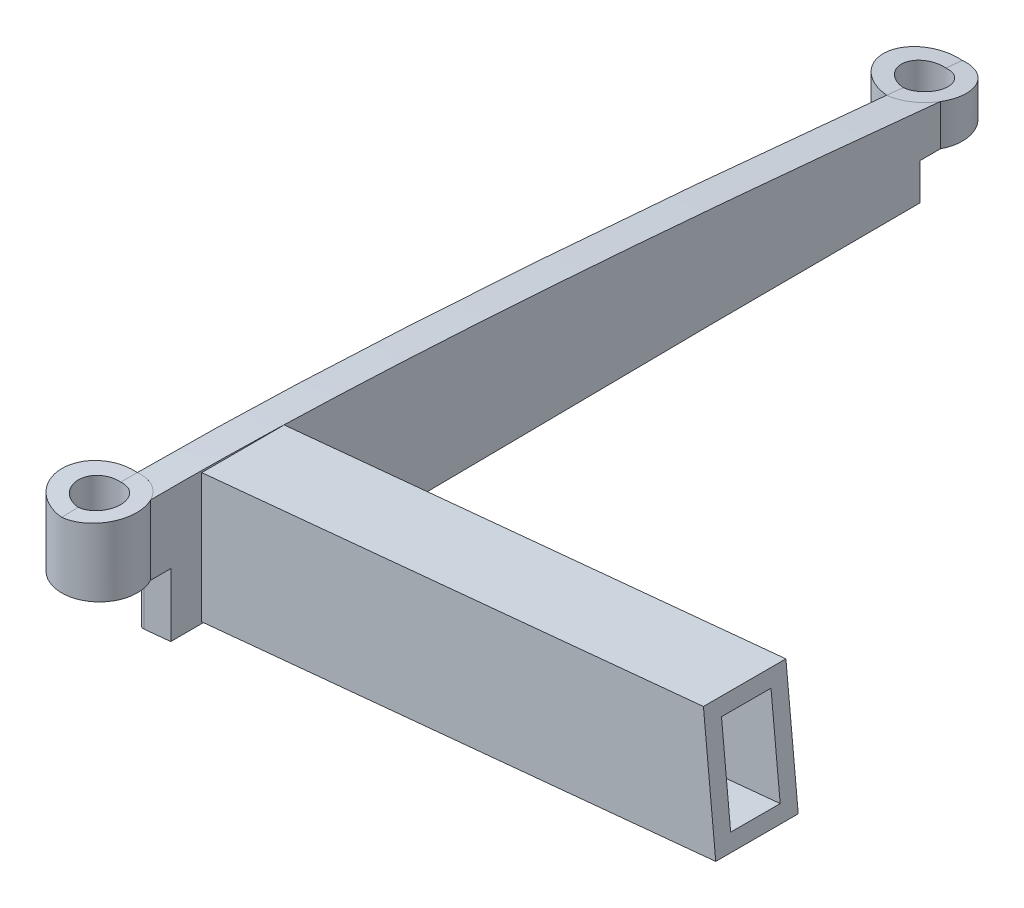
ISO-10303-21;
HEADER;
FILE_DESCRIPTION(('STEP AP214'),'2;1');
FILE_NAME('part.step','',(''),(''),'','','');
FILE_SCHEMA(('AUTOMOTIVE_DESIGN { 1 0 10303 214 1 1 1 1 }'));
ENDSEC;
DATA;
#1=APPLICATION_CONTEXT('core data for automotive mechanical design processes');
#2=APPLICATION_PROTOCOL_DEFINITION('international standard','automotive_design',2000,#1);
#3=PRODUCT_CONTEXT('',#1,'mechanical');
#4=PRODUCT('Part','Part','',(#3));
#5=PRODUCT_RELATED_PRODUCT_CATEGORY('part','',(#4));
#6=PRODUCT_DEFINITION_FORMATION('','',#4);
#7=PRODUCT_DEFINITION_CONTEXT('part definition',#1,'design');
#8=PRODUCT_DEFINITION('design','',#6,#7);
#9=PRODUCT_DEFINITION_SHAPE('','',#8);
#10=(LENGTH_UNIT() NAMED_UNIT(*) SI_UNIT(.MILLI.,.METRE.));
#11=(NAMED_UNIT(*) PLANE_ANGLE_UNIT() SI_UNIT($,.RADIAN.));
#12=(NAMED_UNIT(*) SI_UNIT($,.STERADIAN.) SOLID_ANGLE_UNIT());
#13=UNCERTAINTY_MEASURE_WITH_UNIT(LENGTH_MEASURE(1.E-05),#10,'distance_accuracy_value','');
#14=(GEOMETRIC_REPRESENTATION_CONTEXT(3) GLOBAL_UNCERTAINTY_ASSIGNED_CONTEXT((#13)) GLOBAL_UNIT_ASSIGNED_CONTEXT((#10,
#11,#12)) REPRESENTATION_CONTEXT('',''));
#15=CARTESIAN_POINT('',(0.,0.,0.));
#16=DIRECTION('',(0.,0.,1.));
#17=DIRECTION('',(1.,0.,0.));
#18=AXIS2_PLACEMENT_3D('',#15,#16,#17);
#19=CARTESIAN_POINT('',(0.,14.0330838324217,-7.93030916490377));
#20=CARTESIAN_POINT('',(39.8158479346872,17.8669139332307,-7.93030916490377));
#21=CARTESIAN_POINT('',(0.,14.1778514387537,-8.56036657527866));
#22=CARTESIAN_POINT('',(39.8158479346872,18.0116815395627,-8.56036657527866));
#23=CARTESIAN_POINT('',(0.,14.4430968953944,-9.84080976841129));
#24=CARTESIAN_POINT('',(39.8158479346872,18.2769269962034,-9.84080976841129));
#25=CARTESIAN_POINT('',(0.,14.7761435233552,-11.7909062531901));
#26=CARTESIAN_POINT('',(39.8158479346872,18.6099736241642,-11.7909062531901));
#27=CARTESIAN_POINT('',(0.,15.0578193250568,-13.7816396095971));
#28=CARTESIAN_POINT('',(39.8158479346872,18.8916494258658,-13.7816396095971));
#29=CARTESIAN_POINT('',(0.,15.2937601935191,-15.8017719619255));
#30=CARTESIAN_POINT('',(39.8158479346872,19.127590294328,-15.8017719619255));
#31=CARTESIAN_POINT('',(0.,15.4898728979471,-17.8448093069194));
#32=CARTESIAN_POINT('',(39.8158479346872,19.3237029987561,-17.8448093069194));
#33=CARTESIAN_POINT('',(0.,15.6505340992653,-19.9048690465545));
#34=CARTESIAN_POINT('',(39.8158479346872,19.4843642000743,-19.9048690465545));
#35=CARTESIAN_POINT('',(0.,15.7796714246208,-21.9790390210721));
#36=CARTESIAN_POINT('',(39.8158479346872,19.6135015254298,-21.9790390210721));
#37=CARTESIAN_POINT('',(0.,15.8798485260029,-24.0639857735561));
#38=CARTESIAN_POINT('',(39.8158479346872,19.7136786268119,-24.0639857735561));
#39=CARTESIAN_POINT('',(0.,15.9553569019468,-26.1573831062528));
#40=CARTESIAN_POINT('',(39.8158479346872,19.7891870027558,-26.1573831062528));
#41=CARTESIAN_POINT('',(0.,16.0063512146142,-28.2574491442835));
#42=CARTESIAN_POINT('',(39.8158479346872,19.8401813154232,-28.2574491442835));
#43=CARTESIAN_POINT('',(0.,16.0368385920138,-30.3627478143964));
#44=CARTESIAN_POINT('',(39.8158479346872,19.8706686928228,-30.3627478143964));
#45=CARTESIAN_POINT('',(0.,16.0468372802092,-32.472924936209));
#46=CARTESIAN_POINT('',(39.8158479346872,19.8806673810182,-32.472924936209));
#47=CARTESIAN_POINT('',(0.,16.0385197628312,-34.5871906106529));
#48=CARTESIAN_POINT('',(39.8158479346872,19.8723498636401,-34.5871906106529));
#49=CARTESIAN_POINT('',(0.,16.0141932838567,-36.7050492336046));
#50=CARTESIAN_POINT('',(39.8158479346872,19.8480233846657,-36.7050492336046));
#51=CARTESIAN_POINT('',(0.,15.9737064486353,-38.8260674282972));
#52=CARTESIAN_POINT('',(39.8158479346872,19.8075365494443,-38.8260674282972));
#53=CARTESIAN_POINT('',(0.,15.9193336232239,-40.9498371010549));
#54=CARTESIAN_POINT('',(39.8158479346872,19.7531637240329,-40.9498371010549));
#55=CARTESIAN_POINT('',(0.,15.8513941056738,-43.0759701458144));
#56=CARTESIAN_POINT('',(39.8158479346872,19.6852242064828,-43.0759701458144));
#57=CARTESIAN_POINT('',(0.,15.7710829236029,-45.2042482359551));
#58=CARTESIAN_POINT('',(39.8158479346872,19.6049130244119,-45.2042482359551));
#59=CARTESIAN_POINT('',(0.,15.6789432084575,-47.33437937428));
#60=CARTESIAN_POINT('',(39.8158479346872,19.5127733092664,-47.33437937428));
#61=CARTESIAN_POINT('',(0.,15.5763166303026,-49.4662079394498));
#62=CARTESIAN_POINT('',(39.8158479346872,19.4101467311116,-49.4662079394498));
#63=CARTESIAN_POINT('',(0.,15.4638793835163,-51.599402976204));
#64=CARTESIAN_POINT('',(39.8158479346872,19.2977094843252,-51.599402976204));
#65=CARTESIAN_POINT('',(0.,15.3412639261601,-53.7338778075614));
#66=CARTESIAN_POINT('',(39.8158479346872,19.175094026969,-53.7338778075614));
#67=CARTESIAN_POINT('',(0.,15.2102822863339,-55.8696140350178));
#68=CARTESIAN_POINT('',(39.8158479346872,19.0441123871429,-55.8696140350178));
#69=CARTESIAN_POINT('',(0.,15.0716141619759,-58.006286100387));
#70=CARTESIAN_POINT('',(39.8158479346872,18.9054442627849,-58.006286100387));
#71=CARTESIAN_POINT('',(0.,14.9243494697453,-60.1434521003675));
#72=CARTESIAN_POINT('',(39.8158479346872,18.7581795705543,-60.1434521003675));
#73=CARTESIAN_POINT('',(0.,14.770595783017,-62.2812467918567));
#74=CARTESIAN_POINT('',(39.8158479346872,18.604425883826,-62.2812467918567));
#75=CARTESIAN_POINT('',(0.,14.6094496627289,-64.4195324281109));
#76=CARTESIAN_POINT('',(39.8158479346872,18.4432797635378,-64.4195324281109));
#77=CARTESIAN_POINT('',(0.,14.4423799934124,-66.5584592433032));
#78=CARTESIAN_POINT('',(39.8158479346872,18.2762100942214,-66.5584592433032));
#79=CARTESIAN_POINT('',(0.,14.2689605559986,-68.6978753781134));
#80=CARTESIAN_POINT('',(39.8158479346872,18.1027906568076,-68.6978753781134));
#81=CARTESIAN_POINT('',(0.,14.0896752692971,-70.8377477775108));
#82=CARTESIAN_POINT('',(39.8158479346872,17.9235053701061,-70.8377477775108));
#83=CARTESIAN_POINT('',(0.,13.9056338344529,-72.9779534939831));
#84=CARTESIAN_POINT('',(39.8158479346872,17.7394639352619,-72.9779534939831));
#85=CARTESIAN_POINT('',(0.,13.7156421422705,-75.1183670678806));
#86=CARTESIAN_POINT('',(39.8158479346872,17.5494722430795,-75.1183670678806));
#87=CARTESIAN_POINT('',(0.,13.5216360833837,-77.2592027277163));
#88=CARTESIAN_POINT('',(39.8158479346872,17.3554661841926,-77.2592027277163));
#89=CARTESIAN_POINT('',(0.,13.3225634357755,-79.4002369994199));
#90=CARTESIAN_POINT('',(39.8158479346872,17.1563935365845,-79.4002369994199));
#91=CARTESIAN_POINT('',(0.,13.1198142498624,-81.5416440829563));
#92=CARTESIAN_POINT('',(39.8158479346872,16.9536443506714,-81.5416440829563));
#93=CARTESIAN_POINT('',(0.,12.9125362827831,-83.6831668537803));
#94=CARTESIAN_POINT('',(39.8158479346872,16.7463663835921,-83.6831668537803));
#95=CARTESIAN_POINT('',(0.,12.701997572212,-85.8249209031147));
#96=CARTESIAN_POINT('',(39.8158479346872,16.5358276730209,-85.8249209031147));
#97=CARTESIAN_POINT('',(0.,12.487474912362,-87.9666604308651));
#98=CARTESIAN_POINT('',(39.8158479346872,16.321305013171,-87.9666604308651));
#99=CARTESIAN_POINT('',(0.,12.2698440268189,-90.1087247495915));
#100=CARTESIAN_POINT('',(39.8158479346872,16.1036741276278,-90.1087247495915));
#101=CARTESIAN_POINT('',(0.,12.0489500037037,-92.2509304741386));
#102=CARTESIAN_POINT('',(39.8158479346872,15.8827801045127,-92.2509304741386));
#103=CARTESIAN_POINT('',(0.,11.8248501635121,-94.3932197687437));
#104=CARTESIAN_POINT('',(39.8158479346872,15.6586802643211,-94.3932197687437));
#105=CARTESIAN_POINT('',(0.,11.5980603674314,-96.5355848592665));
#106=CARTESIAN_POINT('',(39.8158479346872,15.4318904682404,-96.5355848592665));
#107=CARTESIAN_POINT('',(0.,11.3683884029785,-98.6780936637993));
#108=CARTESIAN_POINT('',(39.8158479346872,15.2022185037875,-98.6780936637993));
#109=CARTESIAN_POINT('',(0.,11.13632573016,-100.820740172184));
#110=CARTESIAN_POINT('',(39.8158479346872,14.9701558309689,-100.820740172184));
#111=CARTESIAN_POINT('',(0.,10.9017723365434,-102.963350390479));
#112=CARTESIAN_POINT('',(39.8158479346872,14.7356024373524,-102.963350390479));
#113=CARTESIAN_POINT('',(0.,10.6645796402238,-105.105999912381));
#114=CARTESIAN_POINT('',(39.8158479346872,14.4984097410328,-105.105999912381));
#115=CARTESIAN_POINT('',(0.,10.425543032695,-107.248816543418));
#116=CARTESIAN_POINT('',(39.8158479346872,14.259373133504,-107.248816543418));
#117=CARTESIAN_POINT('',(0.,10.1845104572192,-109.39177677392));
#118=CARTESIAN_POINT('',(39.8158479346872,14.0183405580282,-109.39177677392));
#119=CARTESIAN_POINT('',(0.,9.98090671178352,-111.1842186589));
#120=CARTESIAN_POINT('',(39.8158479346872,13.8147368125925,-111.1842186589));
#121=CARTESIAN_POINT('',(0.,9.85788191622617,-112.262385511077));
#122=CARTESIAN_POINT('',(39.8158479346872,13.6917120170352,-112.262385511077));
#123=CARTESIAN_POINT('',(0.,9.81629040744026,-112.626266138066));
#124=CARTESIAN_POINT('',(39.8158479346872,13.6501205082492,-112.626266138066));
#125=B_SPLINE_SURFACE_WITH_KNOTS('',3,1,((#19,#20),(#21,#22),(#23,#24),(#25,#26),(#27,#28),(#29,
#30),(#31,#32),(#33,#34),(#35,#36),(#37,#38),(#39,#40),(#41,#42),(#43,#44),(#45,#46),(#47,#48),
(#49,#50),(#51,#52),(#53,#54),(#55,#56),(#57,#58),(#59,#60),(#61,#62),(#63,#64),(#65,#66),(#67,
#68),(#69,#70),(#71,#72),(#73,#74),(#75,#76),(#77,#78),(#79,#80),(#81,#82),(#83,#84),(#85,#86),
(#87,#88),(#89,#90),(#91,#92),(#93,#94),(#95,#96),(#97,#98),(#99,#100),(#101,#102),(#103,#104),
(#105,#106),(#107,#108),(#109,#110),(#111,#112),(#113,#114),(#115,#116),(#117,#118),(#119,#120),
(#121,#122),(#123,#124)),.UNSPECIFIED.,.F.,.F.,.F.,(4,1,1,1,1,1,1,1,1,1,1,1,1,1,1,1,1,1,1,1,1,1,
1,1,1,1,1,1,1,1,1,1,1,1,1,1,1,1,1,1,1,1,1,1,1,1,1,1,1,1,4),(2,2),(0.,0.0184507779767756,
0.0373147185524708,0.0564582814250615,0.0758319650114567,0.0953626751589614,0.115037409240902,
0.134808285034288,0.15467834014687,0.174615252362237,0.194597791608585,0.21463722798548,
0.23471238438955,0.254828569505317,0.274984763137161,0.295166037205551,0.315379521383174,
0.335623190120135,0.355883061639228,0.376170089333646,0.396480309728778,0.416802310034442,
0.437142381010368,0.457505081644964,0.477877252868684,0.498257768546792,0.518650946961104,
0.539054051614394,0.559464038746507,0.579888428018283,0.600319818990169,0.620756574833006,
0.641201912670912,0.661654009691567,0.682113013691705,0.702577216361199,0.723049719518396,
0.743524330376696,0.764004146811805,0.784487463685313,0.804980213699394,0.82547352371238,
0.84596867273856,0.866471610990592,0.886977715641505,0.907484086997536,0.927993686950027,
0.948509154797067,0.969026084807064,0.989546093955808,1.),(0.,1.),.UNSPECIFIED.);
#126=CARTESIAN_POINT('',(0.,12.4381240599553,-88.45));
#127=CARTESIAN_POINT('',(0.0432861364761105,12.4422919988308,-88.4500003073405));
#128=CARTESIAN_POINT('',(0.0865697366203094,12.4462761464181,-88.4518144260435));
#129=CARTESIAN_POINT('',(0.17286720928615,12.4538522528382,-88.4590607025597));
#130=CARTESIAN_POINT('',(0.215881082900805,12.4574442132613,-88.4644928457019));
#131=CARTESIAN_POINT('',(0.344006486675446,12.4675858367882,-88.48618246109));
#132=CARTESIAN_POINT('',(0.428319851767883,12.4735126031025,-88.5078331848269));
#133=CARTESIAN_POINT('',(0.592252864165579,12.4835106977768,-88.5649785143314));
#134=CARTESIAN_POINT('',(0.67186930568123,12.4875807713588,-88.6004824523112));
#135=CARTESIAN_POINT('',(0.824081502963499,12.4937381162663,-88.6843506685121));
#136=CARTESIAN_POINT('',(0.896679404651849,12.4958259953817,-88.7327109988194));
#137=CARTESIAN_POINT('',(1.03241823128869,12.4979473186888,-88.840648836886));
#138=CARTESIAN_POINT('',(1.09560533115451,12.4979911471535,-88.9001681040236));
#139=CARTESIAN_POINT('',(1.21117337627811,12.4960455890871,-89.0288968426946));
#140=CARTESIAN_POINT('',(1.26355258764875,12.4940558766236,-89.0981078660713));
#141=CARTESIAN_POINT('',(1.35592359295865,12.4881047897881,-89.2440789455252));
#142=CARTESIAN_POINT('',(1.39594009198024,12.48414738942,-89.3208235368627));
#143=CARTESIAN_POINT('',(1.46263670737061,12.4743776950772,-89.4797855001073));
#144=CARTESIAN_POINT('',(1.48931758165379,12.4685655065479,-89.562002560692));
#145=CARTESIAN_POINT('',(1.52874019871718,12.4552253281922,-89.7299526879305));
#146=CARTESIAN_POINT('',(1.54142152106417,12.4476900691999,-89.8156993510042));
#147=CARTESIAN_POINT('',(1.55235490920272,12.4311353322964,-89.9879657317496));
#148=CARTESIAN_POINT('',(1.55060601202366,12.4221157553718,-90.074485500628));
#149=CARTESIAN_POINT('',(1.53271621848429,12.4027652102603,-90.2466446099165));
#150=CARTESIAN_POINT('',(1.51645070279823,12.3924235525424,-90.3322698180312));
#151=CARTESIAN_POINT('',(1.46988473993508,12.3707887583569,-90.499475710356));
#152=CARTESIAN_POINT('',(1.43958362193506,12.3594955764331,-90.5810562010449));
#153=CARTESIAN_POINT('',(1.36545177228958,12.3361594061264,-90.7387077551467));
#154=CARTESIAN_POINT('',(1.32149705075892,12.3241103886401,-90.8147200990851));
#155=CARTESIAN_POINT('',(1.24653170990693,12.3058248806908,-90.9222666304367));
#156=CARTESIAN_POINT('',(1.22003176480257,12.2996931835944,-90.9570428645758));
#157=CARTESIAN_POINT('',(1.16416886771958,12.2873915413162,-91.0242666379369));
#158=CARTESIAN_POINT('',(1.13480316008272,12.2812215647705,-91.0567118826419));
#159=CARTESIAN_POINT('',(1.04241687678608,12.2626642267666,-91.1504699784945));
#160=CARTESIAN_POINT('',(0.975339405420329,12.2502860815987,-91.2078723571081));
#161=CARTESIAN_POINT('',(0.83237522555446,12.2259329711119,-91.3104937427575));
#162=CARTESIAN_POINT('',(0.75648897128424,12.2139579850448,-91.3557133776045));
#163=CARTESIAN_POINT('',(0.637697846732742,12.1965595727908,-91.4134314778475));
#164=CARTESIAN_POINT('',(0.597233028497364,12.1908489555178,-91.4309974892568));
#165=CARTESIAN_POINT('',(0.514968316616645,12.1796614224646,-91.4626175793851));
#166=CARTESIAN_POINT('',(0.473169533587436,12.1741843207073,-91.4766744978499));
#167=CARTESIAN_POINT('',(0.346228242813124,12.1581673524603,-91.5133914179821));
#168=CARTESIAN_POINT('',(0.259375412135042,12.1480176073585,-91.5306778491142));
#169=CARTESIAN_POINT('',(0.143238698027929,12.1354954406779,-91.5436364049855));
#170=CARTESIAN_POINT('',(0.114629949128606,12.132494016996,-91.5460231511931));
#171=CARTESIAN_POINT('',(0.0573553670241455,12.1266504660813,-91.5492023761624));
#172=CARTESIAN_POINT('',(0.0286897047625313,12.1238080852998,-91.5499974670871));
#173=CARTESIAN_POINT('',(0.,12.121045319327,-91.55));
#174=B_SPLINE_CURVE_WITH_KNOTS('',3,(#126,#127,#128,#129,#130,#131,#132,#133,#134,#135,#136,
#137,#138,#139,#140,#141,#142,#143,#144,#145,#146,#147,#148,#149,#150,#151,#152,#153,#154,#155,
#156,#157,#158,#159,#160,#161,#162,#163,#164,#165,#166,#167,#168,#169,#170,#171,#172,#173),
.UNSPECIFIED.,.F.,.F.,(4,2,2,2,2,2,2,2,2,2,2,2,2,2,2,2,2,2,2,2,2,2,2,4),(0.,0.13038036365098,
0.260760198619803,0.5211685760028,0.781752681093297,1.04225685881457,1.30143746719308,
1.56065962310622,1.81936035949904,2.0780463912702,2.33784456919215,2.59766008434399,
2.85972769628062,3.12180783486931,3.38634119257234,3.51865868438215,3.65110468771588,
3.91721041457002,4.18330242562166,4.31660201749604,4.44979338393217,4.71562655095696,
4.80219240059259,4.88861606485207),.UNSPECIFIED.);
#175=CARTESIAN_POINT('',(0.,12.4381240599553,-88.45));
#176=VERTEX_POINT('',#175);
#177=CARTESIAN_POINT('',(0.,12.121045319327,-91.55));
#178=VERTEX_POINT('',#177);
#179=EDGE_CURVE('E387',#176,#178,#174,.T.);
#180=CARTESIAN_POINT('',(0.,14.0330838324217,-7.93030916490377));
#181=CARTESIAN_POINT('',(0.,14.1778514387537,-8.56036657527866));
#182=CARTESIAN_POINT('',(0.,14.4430968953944,-9.84080976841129));
#183=CARTESIAN_POINT('',(0.,14.7761435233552,-11.7909062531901));
#184=CARTESIAN_POINT('',(0.,15.0578193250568,-13.7816396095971));
#185=CARTESIAN_POINT('',(0.,15.2937601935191,-15.8017719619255));
#186=CARTESIAN_POINT('',(0.,15.4898728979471,-17.8448093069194));
#187=CARTESIAN_POINT('',(0.,15.6505340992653,-19.9048690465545));
#188=CARTESIAN_POINT('',(0.,15.7796714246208,-21.9790390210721));
#189=CARTESIAN_POINT('',(0.,15.8798485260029,-24.0639857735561));
#190=CARTESIAN_POINT('',(0.,15.9553569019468,-26.1573831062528));
#191=CARTESIAN_POINT('',(0.,16.0063512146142,-28.2574491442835));
#192=CARTESIAN_POINT('',(0.,16.0368385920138,-30.3627478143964));
#193=CARTESIAN_POINT('',(0.,16.0468372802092,-32.472924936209));
#194=CARTESIAN_POINT('',(0.,16.0385197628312,-34.5871906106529));
#195=CARTESIAN_POINT('',(0.,16.0141932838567,-36.7050492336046));
#196=CARTESIAN_POINT('',(0.,15.9737064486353,-38.8260674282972));
#197=CARTESIAN_POINT('',(0.,15.9193336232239,-40.9498371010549));
#198=CARTESIAN_POINT('',(0.,15.8513941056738,-43.0759701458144));
#199=CARTESIAN_POINT('',(0.,15.7710829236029,-45.2042482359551));
#200=CARTESIAN_POINT('',(0.,15.6789432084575,-47.33437937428));
#201=CARTESIAN_POINT('',(0.,15.5763166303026,-49.4662079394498));
#202=CARTESIAN_POINT('',(0.,15.4638793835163,-51.599402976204));
#203=CARTESIAN_POINT('',(0.,15.3412639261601,-53.7338778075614));
#204=CARTESIAN_POINT('',(0.,15.2102822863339,-55.8696140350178));
#205=CARTESIAN_POINT('',(0.,15.0716141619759,-58.006286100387));
#206=CARTESIAN_POINT('',(0.,14.9243494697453,-60.1434521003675));
#207=CARTESIAN_POINT('',(0.,14.770595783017,-62.2812467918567));
#208=CARTESIAN_POINT('',(0.,14.6094496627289,-64.4195324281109));
#209=CARTESIAN_POINT('',(0.,14.4423799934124,-66.5584592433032));
#210=CARTESIAN_POINT('',(0.,14.2689605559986,-68.6978753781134));
#211=CARTESIAN_POINT('',(0.,14.0896752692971,-70.8377477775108));
#212=CARTESIAN_POINT('',(0.,13.9056338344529,-72.9779534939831));
#213=CARTESIAN_POINT('',(0.,13.7156421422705,-75.1183670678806));
#214=CARTESIAN_POINT('',(0.,13.5216360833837,-77.2592027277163));
#215=CARTESIAN_POINT('',(0.,13.3225634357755,-79.4002369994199));
#216=CARTESIAN_POINT('',(0.,13.1198142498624,-81.5416440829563));
#217=CARTESIAN_POINT('',(0.,12.9125362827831,-83.6831668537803));
#218=CARTESIAN_POINT('',(0.,12.701997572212,-85.8249209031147));
#219=CARTESIAN_POINT('',(0.,12.487474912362,-87.9666604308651));
#220=CARTESIAN_POINT('',(0.,12.2698440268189,-90.1087247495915));
#221=CARTESIAN_POINT('',(0.,12.0489500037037,-92.2509304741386));
#222=CARTESIAN_POINT('',(0.,11.8248501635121,-94.3932197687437));
#223=CARTESIAN_POINT('',(0.,11.5980603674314,-96.5355848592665));
#224=CARTESIAN_POINT('',(0.,11.3683884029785,-98.6780936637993));
#225=CARTESIAN_POINT('',(0.,11.13632573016,-100.820740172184));
#226=CARTESIAN_POINT('',(0.,10.9017723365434,-102.963350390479));
#227=CARTESIAN_POINT('',(0.,10.6645796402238,-105.105999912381));
#228=CARTESIAN_POINT('',(0.,10.425543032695,-107.248816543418));
#229=CARTESIAN_POINT('',(0.,10.1845104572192,-109.39177677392));
#230=CARTESIAN_POINT('',(0.,9.98090671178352,-111.1842186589));
#231=CARTESIAN_POINT('',(0.,9.85788191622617,-112.262385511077));
#232=CARTESIAN_POINT('',(0.,9.81629040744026,-112.626266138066));
#233=B_SPLINE_CURVE_WITH_KNOTS('',3,(#180,#181,#182,#183,#184,#185,#186,#187,#188,#189,#190,
#191,#192,#193,#194,#195,#196,#197,#198,#199,#200,#201,#202,#203,#204,#205,#206,#207,#208,#209,
#210,#211,#212,#213,#214,#215,#216,#217,#218,#219,#220,#221,#222,#223,#224,#225,#226,#227,#228,
#229,#230,#231,#232),.UNSPECIFIED.,.F.,.F.,(4,1,1,1,1,1,1,1,1,1,1,1,1,1,1,1,1,1,1,1,1,1,1,1,1,1,
1,1,1,1,1,1,1,1,1,1,1,1,1,1,1,1,1,1,1,1,1,1,1,1,4),(0.136276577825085,0.142480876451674,
0.148824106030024,0.155261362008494,0.161775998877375,0.168343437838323,0.174959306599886,
0.181607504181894,0.188289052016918,0.194993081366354,0.201712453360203,0.208450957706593,
0.215201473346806,0.221965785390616,0.22874355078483,0.235529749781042,0.242326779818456,
0.249133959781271,0.255946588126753,0.262768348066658,0.269597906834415,0.276431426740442,
0.28327102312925,0.290118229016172,0.296968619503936,0.303821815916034,0.310679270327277,
0.317540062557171,0.324403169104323,0.3312711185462,0.338141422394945,0.345013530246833,
0.351888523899,0.35876579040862,0.365645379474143,0.372526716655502,0.379410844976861,
0.386295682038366,0.39318226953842,0.400070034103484,0.406960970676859,0.413852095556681,
0.420743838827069,0.427638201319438,0.434533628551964,0.441429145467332,0.448325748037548,
0.455224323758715,0.462123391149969,0.469023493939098,0.472538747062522),.UNSPECIFIED.);
#234=CARTESIAN_POINT('',(0.,12.5590817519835,-87.25));
#235=VERTEX_POINT('',#234);
#236=EDGE_CURVE('E438',#235,#176,#233,.T.);
#237=CARTESIAN_POINT('',(0.,11.9964973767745,-92.75));
#238=CARTESIAN_POINT('',(0.0778653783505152,12.0039941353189,-92.7500074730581));
#239=CARTESIAN_POINT('',(0.155692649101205,12.0118334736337,-92.7466929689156));
#240=CARTESIAN_POINT('',(0.310715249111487,12.0281356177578,-92.7334953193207));
#241=CARTESIAN_POINT('',(0.387910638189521,12.0365983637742,-92.7236128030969));
#242=CARTESIAN_POINT('',(0.541052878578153,12.0540784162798,-92.6973674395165));
#243=CARTESIAN_POINT('',(0.61700089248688,12.0630951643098,-92.6810110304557));
#244=CARTESIAN_POINT('',(0.767167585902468,12.0816209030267,-92.6419653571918));
#245=CARTESIAN_POINT('',(0.841386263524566,12.0911298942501,-92.6192760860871));
#246=CARTESIAN_POINT('',(1.06070074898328,12.1202993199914,-92.5419268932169));
#247=CARTESIAN_POINT('',(1.20255619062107,12.1406137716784,-92.477968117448));
#248=CARTESIAN_POINT('',(1.47327281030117,12.1823523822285,-92.327231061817));
#249=CARTESIAN_POINT('',(1.6021349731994,12.2037764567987,-92.240454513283));
#250=CARTESIAN_POINT('',(1.84412623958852,12.2472642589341,-92.0459524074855));
#251=CARTESIAN_POINT('',(1.95715843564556,12.269331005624,-91.9381067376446));
#252=CARTESIAN_POINT('',(2.16339350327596,12.3133468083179,-91.7048387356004));
#253=CARTESIAN_POINT('',(2.25659343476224,12.3352958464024,-91.5794138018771));
#254=CARTESIAN_POINT('',(2.42073321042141,12.3785040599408,-91.3141334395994));
#255=CARTESIAN_POINT('',(2.4916081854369,12.3997610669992,-91.1742374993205));
#256=CARTESIAN_POINT('',(2.60863799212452,12.4408973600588,-90.8842786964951));
#257=CARTESIAN_POINT('',(2.65479447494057,12.4607767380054,-90.734216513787));
#258=CARTESIAN_POINT('',(2.72084585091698,12.4985053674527,-90.4287501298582));
#259=CARTESIAN_POINT('',(2.74083577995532,12.5163617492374,-90.2733673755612));
#260=CARTESIAN_POINT('',(2.75416020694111,12.5495997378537,-89.9611941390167));
#261=CARTESIAN_POINT('',(2.74749529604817,12.5649813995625,-89.8044036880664));
#262=CARTESIAN_POINT('',(2.70774096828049,12.5926912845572,-89.4953113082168));
#263=CARTESIAN_POINT('',(2.67487886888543,12.6050445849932,-89.3429824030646));
#264=CARTESIAN_POINT('',(2.58383997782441,12.6265024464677,-89.0458453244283));
#265=CARTESIAN_POINT('',(2.5256646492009,12.6356071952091,-88.901036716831));
#266=CARTESIAN_POINT('',(2.38626853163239,12.6502300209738,-88.6245109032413));
#267=CARTESIAN_POINT('',(2.30527229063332,12.6557814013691,-88.4926822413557));
#268=CARTESIAN_POINT('',(2.12229233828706,12.6632771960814,-88.244393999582));
#269=CARTESIAN_POINT('',(2.0203105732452,12.6652219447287,-88.127932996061));
#270=CARTESIAN_POINT('',(1.79898671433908,12.6654580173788,-87.9144200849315));
#271=CARTESIAN_POINT('',(1.6797588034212,12.663772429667,-87.8172497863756));
#272=CARTESIAN_POINT('',(1.42681821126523,12.6568548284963,-87.6441183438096));
#273=CARTESIAN_POINT('',(1.2931010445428,12.6516217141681,-87.5681637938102));
#274=CARTESIAN_POINT('',(1.01502099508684,12.6377756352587,-87.4395849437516));
#275=CARTESIAN_POINT('',(0.870654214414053,12.6291614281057,-87.3869692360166));
#276=CARTESIAN_POINT('',(0.575506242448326,12.608818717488,-87.3065611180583));
#277=CARTESIAN_POINT('',(0.424735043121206,12.5970949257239,-87.278731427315));
#278=CARTESIAN_POINT('',(0.22760190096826,12.5800886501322,-87.2590523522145));
#279=CARTESIAN_POINT('',(0.182092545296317,12.5760476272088,-87.2556550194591));
#280=CARTESIAN_POINT('',(0.0910577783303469,12.5677359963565,-87.251131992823));
#281=CARTESIAN_POINT('',(0.045532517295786,12.5634657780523,-87.2500025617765));
#282=CARTESIAN_POINT('',(0.,12.5590817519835,-87.25));
#283=B_SPLINE_CURVE_WITH_KNOTS('',3,(#237,#238,#239,#240,#241,#242,#243,#244,#245,#246,#247,
#248,#249,#250,#251,#252,#253,#254,#255,#256,#257,#258,#259,#260,#261,#262,#263,#264,#265,#266,
#267,#268,#269,#270,#271,#272,#273,#274,#275,#276,#277,#278,#279,#280,#281,#282),.UNSPECIFIED.,
.F.,.F.,(4,2,2,2,2,2,2,2,2,2,2,2,2,2,2,2,2,2,2,2,2,2,4),(0.,0.234596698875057,0.4691709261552,
0.703512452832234,0.93785423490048,1.40623170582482,1.87457364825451,2.34566785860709,
2.81683185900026,3.28935254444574,3.76184166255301,4.23260991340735,4.70336772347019,
5.17008457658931,5.63677445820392,6.09902371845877,6.56123012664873,7.02050566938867,
7.47992379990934,7.93951092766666,8.39840561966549,8.5358110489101,8.67298986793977),.UNSPECIFIED.);
#284=CARTESIAN_POINT('',(0.,11.9964973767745,-92.7499999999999));
#285=VERTEX_POINT('',#284);
#286=EDGE_CURVE('E303',#285,#235,#283,.T.);
#287=EDGE_CURVE('E432',#178,#285,#233,.T.);
#288=ORIENTED_EDGE('',*,*,#179,.F.);
#289=ORIENTED_EDGE('',*,*,#236,.F.);
#290=ORIENTED_EDGE('',*,*,#286,.F.);
#291=ORIENTED_EDGE('',*,*,#287,.F.);
#292=EDGE_LOOP('',(#288,#289,#290,#291));
#293=FACE_BOUND('',#292,.T.);
#294=ADVANCED_FACE('F39',(#293),#125,.F.);
#295=CARTESIAN_POINT('',(0.,16.006561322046,-28.45));
#296=CARTESIAN_POINT('',(0.0438039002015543,16.0107790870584,-28.4500003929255));
#297=CARTESIAN_POINT('',(0.0875834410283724,16.01502899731,-28.451858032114));
#298=CARTESIAN_POINT('',(0.174822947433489,16.023565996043,-28.4592679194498));
#299=CARTESIAN_POINT('',(0.2182829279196,16.0278530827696,-28.4648199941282));
#300=CARTESIAN_POINT('',(0.347653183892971,16.0407170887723,-28.4869660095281));
#301=CARTESIAN_POINT('',(0.432687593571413,16.0493096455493,-28.5090498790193));
#302=CARTESIAN_POINT('',(0.597832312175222,16.0662629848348,-28.5672489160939));
#303=CARTESIAN_POINT('',(0.677940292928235,16.0746236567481,-28.6033706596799));
#304=CARTESIAN_POINT('',(0.830948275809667,16.0908546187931,-28.6886309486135));
#305=CARTESIAN_POINT('',(0.903849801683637,16.0987250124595,-28.7377667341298));
#306=CARTESIAN_POINT('',(1.04028100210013,16.1137169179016,-28.8476203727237));
#307=CARTESIAN_POINT('',(1.10382104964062,16.120839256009,-28.9083252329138));
#308=CARTESIAN_POINT('',(1.21980088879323,16.1341139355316,-29.0396559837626));
#309=CARTESIAN_POINT('',(1.27223921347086,16.1402661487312,-29.1102831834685));
#310=CARTESIAN_POINT('',(1.36426888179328,16.1513698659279,-29.2591263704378));
#311=CARTESIAN_POINT('',(1.40391443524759,16.1563264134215,-29.337308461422));
#312=CARTESIAN_POINT('',(1.46949682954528,16.1649059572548,-29.4992880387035));
#313=CARTESIAN_POINT('',(1.49543494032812,16.1685290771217,-29.5830850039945));
#314=CARTESIAN_POINT('',(1.53273781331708,16.1743053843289,-29.7534619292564));
#315=CARTESIAN_POINT('',(1.54417625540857,16.1764659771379,-29.8400255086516));
#316=CARTESIAN_POINT('',(1.55237885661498,16.1792766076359,-30.0138702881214));
#317=CARTESIAN_POINT('',(1.54914302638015,16.1799266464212,-30.101151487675));
#318=CARTESIAN_POINT('',(1.52811725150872,16.1796991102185,-30.2736408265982));
#319=CARTESIAN_POINT('',(1.51037686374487,16.1788267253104,-30.3588550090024));
#320=CARTESIAN_POINT('',(1.4609271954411,16.1756018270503,-30.5250862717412));
#321=CARTESIAN_POINT('',(1.42921801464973,16.1732493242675,-30.6061033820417));
#322=CARTESIAN_POINT('',(1.3527070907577,16.1671482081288,-30.7617024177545));
#323=CARTESIAN_POINT('',(1.30790401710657,16.1633994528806,-30.8362836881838));
#324=CARTESIAN_POINT('',(1.23194327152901,16.1568367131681,-30.9416463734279));
#325=CARTESIAN_POINT('',(1.20515786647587,16.1544920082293,-30.97568812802));
#326=CARTESIAN_POINT('',(1.14882105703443,16.1495062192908,-31.0414343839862));
#327=CARTESIAN_POINT('',(1.11926705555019,16.1468648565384,-31.0731366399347));
#328=CARTESIAN_POINT('',(1.02662117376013,16.1385152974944,-31.1645062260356));
#329=CARTESIAN_POINT('',(0.95965288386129,16.1323909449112,-31.2202875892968));
#330=CARTESIAN_POINT('',(0.81738600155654,16.1192412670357,-31.3198172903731));
#331=CARTESIAN_POINT('',(0.742087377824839,16.1122159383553,-31.3635655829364));
#332=CARTESIAN_POINT('',(0.624324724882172,16.1011525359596,-31.4193756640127));
#333=CARTESIAN_POINT('',(0.584120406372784,16.0973631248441,-31.4363852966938));
#334=CARTESIAN_POINT('',(0.502474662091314,16.0896457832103,-31.4669423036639));
#335=CARTESIAN_POINT('',(0.461034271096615,16.0857179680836,-31.4804924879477));
#336=CARTESIAN_POINT('',(0.335304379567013,16.0737720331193,-31.5157899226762));
#337=CARTESIAN_POINT('',(0.249448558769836,16.06557660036,-31.5322585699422));
#338=CARTESIAN_POINT('',(0.13588605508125,16.0546937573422,-31.5442744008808));
#339=CARTESIAN_POINT('',(0.108729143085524,16.0520881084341,-31.5464225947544));
#340=CARTESIAN_POINT('',(0.054386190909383,16.046867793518,-31.5492830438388));
#341=CARTESIAN_POINT('',(0.0272002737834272,16.044253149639,-31.5499976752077));
#342=CARTESIAN_POINT('',(0.,16.0416340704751,-31.55));
#343=B_SPLINE_CURVE_WITH_KNOTS('',3,(#295,#296,#297,#298,#299,#300,#301,#302,#303,#304,#305,
#306,#307,#308,#309,#310,#311,#312,#313,#314,#315,#316,#317,#318,#319,#320,#321,#322,#323,#324,
#325,#326,#327,#328,#329,#330,#331,#332,#333,#334,#335,#336,#337,#338,#339,#340,#341,#342),
.UNSPECIFIED.,.F.,.F.,(4,2,2,2,2,2,2,2,2,2,2,2,2,2,2,2,2,2,2,2,2,2,2,4),(0.,0.131938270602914,
0.263870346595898,0.527336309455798,0.790925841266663,1.05445951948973,1.31769895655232,
1.58097315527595,1.84311660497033,2.10523576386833,2.36601755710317,2.62679916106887,
2.88669347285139,3.14658592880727,3.4065048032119,3.53651264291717,3.66664368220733,
3.92745005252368,4.18825740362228,4.31957357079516,4.45078273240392,4.71268237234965,
4.79475796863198,4.87669741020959),.UNSPECIFIED.);
#344=CARTESIAN_POINT('',(0.,16.006561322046,-28.45));
#345=VERTEX_POINT('',#344);
#346=CARTESIAN_POINT('',(0.,16.0416340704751,-31.55));
#347=VERTEX_POINT('',#346);
#348=EDGE_CURVE('E350',#345,#347,#343,.T.);
#349=CARTESIAN_POINT('',(0.,15.9809499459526,-27.25));
#350=VERTEX_POINT('',#349);
#351=EDGE_CURVE('E439',#350,#345,#233,.T.);
#352=CARTESIAN_POINT('',(0.,16.0437387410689,-32.75));
#353=CARTESIAN_POINT('',(0.0776040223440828,16.0512108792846,-32.7500072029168));
#354=CARTESIAN_POINT('',(0.155204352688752,16.0586856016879,-32.7467150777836));
#355=CARTESIAN_POINT('',(0.309851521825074,16.0735855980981,-32.7335881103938));
#356=CARTESIAN_POINT('',(0.386898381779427,16.081010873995,-32.7237535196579));
#357=CARTESIAN_POINT('',(0.539855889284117,16.0957538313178,-32.6976048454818));
#358=CARTESIAN_POINT('',(0.6157671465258,16.1030715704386,-32.6812943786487));
#359=CARTESIAN_POINT('',(0.765934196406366,16.1175454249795,-32.6423229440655));
#360=CARTESIAN_POINT('',(0.840190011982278,16.124701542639,-32.6196620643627));
#361=CARTESIAN_POINT('',(1.05976196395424,16.1458513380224,-32.5423287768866));
#362=CARTESIAN_POINT('',(1.20194013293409,16.1595320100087,-32.4782958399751));
#363=CARTESIAN_POINT('',(1.47344193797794,16.185570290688,-32.3271521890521));
#364=CARTESIAN_POINT('',(1.60276858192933,16.1979282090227,-32.2400468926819));
#365=CARTESIAN_POINT('',(1.84471299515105,16.2208801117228,-32.0453785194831));
#366=CARTESIAN_POINT('',(1.95736731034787,16.2314779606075,-31.9378614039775));
#367=CARTESIAN_POINT('',(2.16303192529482,16.2505538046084,-31.7052567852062));
#368=CARTESIAN_POINT('',(2.2560396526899,16.2590315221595,-31.5801669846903));
#369=CARTESIAN_POINT('',(2.41925385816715,16.2734990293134,-31.3166642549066));
#370=CARTESIAN_POINT('',(2.48957468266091,16.2795013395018,-31.178322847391));
#371=CARTESIAN_POINT('',(2.60600121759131,16.2888327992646,-30.8917269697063));
#372=CARTESIAN_POINT('',(2.65210921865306,16.2921622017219,-30.7434734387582));
#373=CARTESIAN_POINT('',(2.71861002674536,16.2959865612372,-30.4420118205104));
#374=CARTESIAN_POINT('',(2.73912362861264,16.2964948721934,-30.2888305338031));
#375=CARTESIAN_POINT('',(2.7542433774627,16.294671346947,-29.9812045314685));
#376=CARTESIAN_POINT('',(2.74884933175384,16.2923394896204,-29.8267598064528));
#377=CARTESIAN_POINT('',(2.7123751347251,16.2849186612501,-29.5212989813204));
#378=CARTESIAN_POINT('',(2.68133975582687,16.2798345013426,-29.3702773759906));
#379=CARTESIAN_POINT('',(2.5945083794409,16.2670856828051,-29.0755583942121));
#380=CARTESIAN_POINT('',(2.53871223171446,16.2594210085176,-28.93186106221));
#381=CARTESIAN_POINT('',(2.4377041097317,16.2462004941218,-28.7248349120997));
#382=CARTESIAN_POINT('',(2.40107006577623,16.2414966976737,-28.6571356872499));
#383=CARTESIAN_POINT('',(2.32227978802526,16.2315558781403,-28.5250697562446));
#384=CARTESIAN_POINT('',(2.28012480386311,16.2263189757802,-28.4607023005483));
#385=CARTESIAN_POINT('',(2.19060911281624,16.2153606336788,-28.3357780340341));
#386=CARTESIAN_POINT('',(2.14325043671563,16.2096393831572,-28.2752197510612));
#387=CARTESIAN_POINT('',(2.04362330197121,16.1977574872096,-28.1582569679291));
#388=CARTESIAN_POINT('',(1.9913502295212,16.1915964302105,-28.1018564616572));
#389=CARTESIAN_POINT('',(1.82723535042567,16.1724782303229,-27.9390568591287));
#390=CARTESIAN_POINT('',(1.70845945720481,16.1589304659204,-27.8395634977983));
#391=CARTESIAN_POINT('',(1.45598974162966,16.1307491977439,-27.6619632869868));
#392=CARTESIAN_POINT('',(1.32229588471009,16.1161156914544,-27.5838564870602));
#393=CARTESIAN_POINT('',(1.11310398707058,16.0936840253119,-27.4841416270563));
#394=CARTESIAN_POINT('',(1.04165901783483,16.0860984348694,-27.4537334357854));
#395=CARTESIAN_POINT('',(0.896504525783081,16.0708422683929,-27.3990807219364));
#396=CARTESIAN_POINT('',(0.822796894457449,16.0631717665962,-27.3748312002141));
#397=CARTESIAN_POINT('',(0.673678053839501,16.0478107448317,-27.3326681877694));
#398=CARTESIAN_POINT('',(0.598268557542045,16.040120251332,-27.3147486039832));
#399=CARTESIAN_POINT('',(0.446216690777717,16.0247720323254,-27.2853393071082));
#400=CARTESIAN_POINT('',(0.369574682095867,16.0171142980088,-27.2738477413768));
#401=CARTESIAN_POINT('',(0.243973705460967,16.0046946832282,-27.2604070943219));
#402=CARTESIAN_POINT('',(0.195218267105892,15.9999052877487,-27.256502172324));
#403=CARTESIAN_POINT('',(0.0976445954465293,15.9903836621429,-27.2513005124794));
#404=CARTESIAN_POINT('',(0.0488265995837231,15.9856513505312,-27.2499994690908));
#405=CARTESIAN_POINT('',(0.,15.9809499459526,-27.25));
#406=B_SPLINE_CURVE_WITH_KNOTS('',3,(#352,#353,#354,#355,#356,#357,#358,#359,#360,#361,#362,
#363,#364,#365,#366,#367,#368,#369,#370,#371,#372,#373,#374,#375,#376,#377,#378,#379,#380,#381,
#382,#383,#384,#385,#386,#387,#388,#389,#390,#391,#392,#393,#394,#395,#396,#397,#398,#399,#400,
#401,#402,#403,#404,#405),.UNSPECIFIED.,.F.,.F.,(4,2,2,2,2,2,2,2,2,2,2,2,2,2,2,2,2,2,2,2,2,2,2,
2,2,2,4),(0.,0.23381307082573,0.467617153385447,0.701290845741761,0.934961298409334,
1.40212852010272,1.86918614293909,2.33520430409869,2.8012834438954,3.26497535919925,
3.72862339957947,4.19007483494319,4.65152970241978,5.11218052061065,5.57283413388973,
5.80396779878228,6.03504923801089,6.26604081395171,6.49725146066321,6.9615144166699,
7.42577844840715,7.65959691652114,7.89322497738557,8.12662753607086,8.35996279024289,
8.50733556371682,8.65446445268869),.UNSPECIFIED.);
#407=CARTESIAN_POINT('',(0.,16.0437387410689,-32.7499999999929));
#408=VERTEX_POINT('',#407);
#409=EDGE_CURVE('E341',#408,#350,#406,.T.);
#410=EDGE_CURVE('E440',#347,#408,#233,.T.);
#411=ORIENTED_EDGE('',*,*,#348,.F.);
#412=ORIENTED_EDGE('',*,*,#351,.F.);
#413=ORIENTED_EDGE('',*,*,#409,.F.);
#414=ORIENTED_EDGE('',*,*,#410,.F.);
#415=EDGE_LOOP('',(#411,#412,#413,#414));
#416=FACE_BOUND('',#415,.T.);
#417=ADVANCED_FACE('F322',(#416),#125,.F.);
#418=CARTESIAN_POINT('',(0.,14.0330838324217,-7.93030916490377));
#419=CARTESIAN_POINT('',(-39.8158479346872,17.8669139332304,-7.93030916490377));
#420=CARTESIAN_POINT('',(0.,14.1778514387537,-8.56036657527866));
#421=CARTESIAN_POINT('',(-39.8158479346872,18.0116815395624,-8.56036657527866));
#422=CARTESIAN_POINT('',(0.,14.4430968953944,-9.84080976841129));
#423=CARTESIAN_POINT('',(-39.8158479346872,18.2769269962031,-9.84080976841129));
#424=CARTESIAN_POINT('',(0.,14.7761435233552,-11.7909062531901));
#425=CARTESIAN_POINT('',(-39.8158479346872,18.6099736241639,-11.7909062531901));
#426=CARTESIAN_POINT('',(0.,15.0578193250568,-13.7816396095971));
#427=CARTESIAN_POINT('',(-39.8158479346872,18.8916494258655,-13.7816396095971));
#428=CARTESIAN_POINT('',(0.,15.2937601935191,-15.8017719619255));
#429=CARTESIAN_POINT('',(-39.8158479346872,19.1275902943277,-15.8017719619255));
#430=CARTESIAN_POINT('',(0.,15.4898728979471,-17.8448093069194));
#431=CARTESIAN_POINT('',(-39.8158479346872,19.3237029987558,-17.8448093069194));
#432=CARTESIAN_POINT('',(0.,15.6505340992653,-19.9048690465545));
#433=CARTESIAN_POINT('',(-39.8158479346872,19.484364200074,-19.9048690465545));
#434=CARTESIAN_POINT('',(0.,15.7796714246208,-21.9790390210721));
#435=CARTESIAN_POINT('',(-39.8158479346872,19.6135015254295,-21.9790390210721));
#436=CARTESIAN_POINT('',(0.,15.8798485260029,-24.0639857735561));
#437=CARTESIAN_POINT('',(-39.8158479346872,19.7136786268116,-24.0639857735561));
#438=CARTESIAN_POINT('',(0.,15.9553569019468,-26.1573831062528));
#439=CARTESIAN_POINT('',(-39.8158479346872,19.7891870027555,-26.1573831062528));
#440=CARTESIAN_POINT('',(0.,16.0063512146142,-28.2574491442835));
#441=CARTESIAN_POINT('',(-39.8158479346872,19.8401813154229,-28.2574491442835));
#442=CARTESIAN_POINT('',(0.,16.0368385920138,-30.3627478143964));
#443=CARTESIAN_POINT('',(-39.8158479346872,19.8706686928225,-30.3627478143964));
#444=CARTESIAN_POINT('',(0.,16.0468372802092,-32.472924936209));
#445=CARTESIAN_POINT('',(-39.8158479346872,19.8806673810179,-32.472924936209));
#446=CARTESIAN_POINT('',(0.,16.0385197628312,-34.5871906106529));
#447=CARTESIAN_POINT('',(-39.8158479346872,19.8723498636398,-34.5871906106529));
#448=CARTESIAN_POINT('',(0.,16.0141932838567,-36.7050492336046));
#449=CARTESIAN_POINT('',(-39.8158479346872,19.8480233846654,-36.7050492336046));
#450=CARTESIAN_POINT('',(0.,15.9737064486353,-38.8260674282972));
#451=CARTESIAN_POINT('',(-39.8158479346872,19.807536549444,-38.8260674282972));
#452=CARTESIAN_POINT('',(0.,15.9193336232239,-40.9498371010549));
#453=CARTESIAN_POINT('',(-39.8158479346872,19.7531637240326,-40.9498371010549));
#454=CARTESIAN_POINT('',(0.,15.8513941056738,-43.0759701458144));
#455=CARTESIAN_POINT('',(-39.8158479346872,19.6852242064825,-43.0759701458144));
#456=CARTESIAN_POINT('',(0.,15.7710829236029,-45.2042482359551));
#457=CARTESIAN_POINT('',(-39.8158479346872,19.6049130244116,-45.2042482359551));
#458=CARTESIAN_POINT('',(0.,15.6789432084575,-47.33437937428));
#459=CARTESIAN_POINT('',(-39.8158479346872,19.5127733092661,-47.33437937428));
#460=CARTESIAN_POINT('',(0.,15.5763166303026,-49.4662079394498));
#461=CARTESIAN_POINT('',(-39.8158479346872,19.4101467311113,-49.4662079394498));
#462=CARTESIAN_POINT('',(0.,15.4638793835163,-51.599402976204));
#463=CARTESIAN_POINT('',(-39.8158479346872,19.2977094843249,-51.599402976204));
#464=CARTESIAN_POINT('',(0.,15.3412639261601,-53.7338778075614));
#465=CARTESIAN_POINT('',(-39.8158479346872,19.1750940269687,-53.7338778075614));
#466=CARTESIAN_POINT('',(0.,15.2102822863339,-55.8696140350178));
#467=CARTESIAN_POINT('',(-39.8158479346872,19.0441123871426,-55.8696140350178));
#468=CARTESIAN_POINT('',(0.,15.0716141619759,-58.006286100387));
#469=CARTESIAN_POINT('',(-39.8158479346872,18.9054442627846,-58.006286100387));
#470=CARTESIAN_POINT('',(0.,14.9243494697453,-60.1434521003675));
#471=CARTESIAN_POINT('',(-39.8158479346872,18.758179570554,-60.1434521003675));
#472=CARTESIAN_POINT('',(0.,14.770595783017,-62.2812467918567));
#473=CARTESIAN_POINT('',(-39.8158479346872,18.6044258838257,-62.2812467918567));
#474=CARTESIAN_POINT('',(0.,14.6094496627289,-64.4195324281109));
#475=CARTESIAN_POINT('',(-39.8158479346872,18.4432797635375,-64.4195324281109));
#476=CARTESIAN_POINT('',(0.,14.4423799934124,-66.5584592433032));
#477=CARTESIAN_POINT('',(-39.8158479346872,18.2762100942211,-66.5584592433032));
#478=CARTESIAN_POINT('',(0.,14.2689605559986,-68.6978753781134));
#479=CARTESIAN_POINT('',(-39.8158479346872,18.1027906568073,-68.6978753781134));
#480=CARTESIAN_POINT('',(0.,14.0896752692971,-70.8377477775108));
#481=CARTESIAN_POINT('',(-39.8158479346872,17.9235053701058,-70.8377477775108));
#482=CARTESIAN_POINT('',(0.,13.9056338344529,-72.9779534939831));
#483=CARTESIAN_POINT('',(-39.8158479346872,17.7394639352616,-72.9779534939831));
#484=CARTESIAN_POINT('',(0.,13.7156421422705,-75.1183670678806));
#485=CARTESIAN_POINT('',(-39.8158479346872,17.5494722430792,-75.1183670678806));
#486=CARTESIAN_POINT('',(0.,13.5216360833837,-77.2592027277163));
#487=CARTESIAN_POINT('',(-39.8158479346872,17.3554661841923,-77.2592027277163));
#488=CARTESIAN_POINT('',(0.,13.3225634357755,-79.4002369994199));
#489=CARTESIAN_POINT('',(-39.8158479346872,17.1563935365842,-79.4002369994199));
#490=CARTESIAN_POINT('',(0.,13.1198142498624,-81.5416440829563));
#491=CARTESIAN_POINT('',(-39.8158479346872,16.9536443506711,-81.5416440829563));
#492=CARTESIAN_POINT('',(0.,12.9125362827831,-83.6831668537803));
#493=CARTESIAN_POINT('',(-39.8158479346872,16.7463663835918,-83.6831668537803));
#494=CARTESIAN_POINT('',(0.,12.701997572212,-85.8249209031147));
#495=CARTESIAN_POINT('',(-39.8158479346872,16.5358276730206,-85.8249209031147));
#496=CARTESIAN_POINT('',(0.,12.487474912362,-87.9666604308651));
#497=CARTESIAN_POINT('',(-39.8158479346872,16.3213050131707,-87.9666604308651));
#498=CARTESIAN_POINT('',(0.,12.2698440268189,-90.1087247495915));
#499=CARTESIAN_POINT('',(-39.8158479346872,16.1036741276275,-90.1087247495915));
#500=CARTESIAN_POINT('',(0.,12.0489500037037,-92.2509304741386));
#501=CARTESIAN_POINT('',(-39.8158479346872,15.8827801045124,-92.2509304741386));
#502=CARTESIAN_POINT('',(0.,11.8248501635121,-94.3932197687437));
#503=CARTESIAN_POINT('',(-39.8158479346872,15.6586802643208,-94.3932197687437));
#504=CARTESIAN_POINT('',(0.,11.5980603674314,-96.5355848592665));
#505=CARTESIAN_POINT('',(-39.8158479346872,15.4318904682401,-96.5355848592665));
#506=CARTESIAN_POINT('',(0.,11.3683884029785,-98.6780936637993));
#507=CARTESIAN_POINT('',(-39.8158479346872,15.2022185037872,-98.6780936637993));
#508=CARTESIAN_POINT('',(0.,11.13632573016,-100.820740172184));
#509=CARTESIAN_POINT('',(-39.8158479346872,14.9701558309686,-100.820740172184));
#510=CARTESIAN_POINT('',(0.,10.9017723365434,-102.963350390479));
#511=CARTESIAN_POINT('',(-39.8158479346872,14.7356024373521,-102.963350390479));
#512=CARTESIAN_POINT('',(0.,10.6645796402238,-105.105999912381));
#513=CARTESIAN_POINT('',(-39.8158479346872,14.4984097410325,-105.105999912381));
#514=CARTESIAN_POINT('',(0.,10.425543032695,-107.248816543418));
#515=CARTESIAN_POINT('',(-39.8158479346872,14.2593731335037,-107.248816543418));
#516=CARTESIAN_POINT('',(0.,10.1845104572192,-109.39177677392));
#517=CARTESIAN_POINT('',(-39.8158479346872,14.0183405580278,-109.39177677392));
#518=CARTESIAN_POINT('',(0.,9.98090671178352,-111.1842186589));
#519=CARTESIAN_POINT('',(-39.8158479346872,13.8147368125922,-111.1842186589));
#520=CARTESIAN_POINT('',(0.,9.85788191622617,-112.262385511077));
#521=CARTESIAN_POINT('',(-39.8158479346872,13.6917120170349,-112.262385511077));
#522=CARTESIAN_POINT('',(0.,9.81629040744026,-112.626266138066));
#523=CARTESIAN_POINT('',(-39.8158479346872,13.6501205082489,-112.626266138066));
#524=B_SPLINE_SURFACE_WITH_KNOTS('',3,1,((#418,#419),(#420,#421),(#422,#423),(#424,#425),(#426,
#427),(#428,#429),(#430,#431),(#432,#433),(#434,#435),(#436,#437),(#438,#439),(#440,#441),(#442,
#443),(#444,#445),(#446,#447),(#448,#449),(#450,#451),(#452,#453),(#454,#455),(#456,#457),(#458,
#459),(#460,#461),(#462,#463),(#464,#465),(#466,#467),(#468,#469),(#470,#471),(#472,#473),(#474,
#475),(#476,#477),(#478,#479),(#480,#481),(#482,#483),(#484,#485),(#486,#487),(#488,#489),(#490,
#491),(#492,#493),(#494,#495),(#496,#497),(#498,#499),(#500,#501),(#502,#503),(#504,#505),(#506,
#507),(#508,#509),(#510,#511),(#512,#513),(#514,#515),(#516,#517),(#518,#519),(#520,#521),(#522,
#523)),.UNSPECIFIED.,.F.,.F.,.F.,(4,1,1,1,1,1,1,1,1,1,1,1,1,1,1,1,1,1,1,1,1,1,1,1,1,1,1,1,1,1,1,
1,1,1,1,1,1,1,1,1,1,1,1,1,1,1,1,1,1,1,4),(2,2),(0.,0.0184507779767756,0.0373147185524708,
0.0564582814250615,0.0758319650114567,0.0953626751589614,0.115037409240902,0.134808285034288,
0.15467834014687,0.174615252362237,0.194597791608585,0.21463722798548,0.23471238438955,
0.254828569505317,0.274984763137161,0.295166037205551,0.315379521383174,0.335623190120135,
0.355883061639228,0.376170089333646,0.396480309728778,0.416802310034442,0.437142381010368,
0.457505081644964,0.477877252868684,0.498257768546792,0.518650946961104,0.539054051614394,
0.559464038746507,0.579888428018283,0.600319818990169,0.620756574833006,0.641201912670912,
0.661654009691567,0.682113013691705,0.702577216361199,0.723049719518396,0.743524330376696,
0.764004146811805,0.784487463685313,0.804980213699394,0.82547352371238,0.84596867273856,
0.866471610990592,0.886977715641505,0.907484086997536,0.927993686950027,0.948509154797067,
0.969026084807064,0.989546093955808,1.),(0.,1.),.UNSPECIFIED.);
#525=CARTESIAN_POINT('',(0.,16.006561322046,-28.45));
#526=CARTESIAN_POINT('',(-0.0438039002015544,16.0107790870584,-28.4500003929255));
#527=CARTESIAN_POINT('',(-0.0875834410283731,16.01502899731,-28.451858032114));
#528=CARTESIAN_POINT('',(-0.17482294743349,16.023565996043,-28.4592679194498));
#529=CARTESIAN_POINT('',(-0.218282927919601,16.0278530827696,-28.4648199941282));
#530=CARTESIAN_POINT('',(-0.347653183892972,16.0407170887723,-28.4869660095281));
#531=CARTESIAN_POINT('',(-0.432687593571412,16.0493096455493,-28.5090498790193));
#532=CARTESIAN_POINT('',(-0.597832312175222,16.0662629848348,-28.5672489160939));
#533=CARTESIAN_POINT('',(-0.677940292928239,16.074623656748,-28.60337065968));
#534=CARTESIAN_POINT('',(-0.830948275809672,16.0908546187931,-28.6886309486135));
#535=CARTESIAN_POINT('',(-0.903849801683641,16.0987250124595,-28.7377667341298));
#536=CARTESIAN_POINT('',(-1.04028100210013,16.1137169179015,-28.8476203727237));
#537=CARTESIAN_POINT('',(-1.10382104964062,16.120839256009,-28.9083252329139));
#538=CARTESIAN_POINT('',(-1.21980088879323,16.1341139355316,-29.0396559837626));
#539=CARTESIAN_POINT('',(-1.27223921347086,16.1402661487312,-29.1102831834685));
#540=CARTESIAN_POINT('',(-1.36426888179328,16.1513698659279,-29.2591263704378));
#541=CARTESIAN_POINT('',(-1.4039144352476,16.1563264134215,-29.337308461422));
#542=CARTESIAN_POINT('',(-1.46949682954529,16.1649059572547,-29.4992880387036));
#543=CARTESIAN_POINT('',(-1.49543494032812,16.1685290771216,-29.5830850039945));
#544=CARTESIAN_POINT('',(-1.53273781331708,16.1743053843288,-29.7534619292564));
#545=CARTESIAN_POINT('',(-1.54417625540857,16.1764659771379,-29.8400255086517));
#546=CARTESIAN_POINT('',(-1.55237885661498,16.1792766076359,-30.0138702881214));
#547=CARTESIAN_POINT('',(-1.54914302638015,16.1799266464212,-30.101151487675));
#548=CARTESIAN_POINT('',(-1.52811725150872,16.1796991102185,-30.2736408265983));
#549=CARTESIAN_POINT('',(-1.51037686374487,16.1788267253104,-30.3588550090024));
#550=CARTESIAN_POINT('',(-1.4609271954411,16.1756018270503,-30.5250862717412));
#551=CARTESIAN_POINT('',(-1.42921801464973,16.1732493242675,-30.6061033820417));
#552=CARTESIAN_POINT('',(-1.3527070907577,16.1671482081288,-30.7617024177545));
#553=CARTESIAN_POINT('',(-1.30790401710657,16.1633994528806,-30.8362836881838));
#554=CARTESIAN_POINT('',(-1.231943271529,16.1568367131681,-30.941646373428));
#555=CARTESIAN_POINT('',(-1.20515786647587,16.1544920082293,-30.97568812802));
#556=CARTESIAN_POINT('',(-1.14882105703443,16.1495062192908,-31.0414343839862));
#557=CARTESIAN_POINT('',(-1.11926705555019,16.1468648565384,-31.0731366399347));
#558=CARTESIAN_POINT('',(-1.02662117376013,16.1385152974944,-31.1645062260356));
#559=CARTESIAN_POINT('',(-0.959652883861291,16.1323909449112,-31.2202875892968));
#560=CARTESIAN_POINT('',(-0.817386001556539,16.1192412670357,-31.3198172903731));
#561=CARTESIAN_POINT('',(-0.742087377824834,16.1122159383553,-31.3635655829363));
#562=CARTESIAN_POINT('',(-0.624324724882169,16.1011525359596,-31.4193756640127));
#563=CARTESIAN_POINT('',(-0.584120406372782,16.0973631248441,-31.4363852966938));
#564=CARTESIAN_POINT('',(-0.502474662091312,16.0896457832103,-31.4669423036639));
#565=CARTESIAN_POINT('',(-0.461034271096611,16.0857179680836,-31.4804924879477));
#566=CARTESIAN_POINT('',(-0.335304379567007,16.0737720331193,-31.5157899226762));
#567=CARTESIAN_POINT('',(-0.249448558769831,16.06557660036,-31.5322585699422));
#568=CARTESIAN_POINT('',(-0.135886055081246,16.0546937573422,-31.5442744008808));
#569=CARTESIAN_POINT('',(-0.108729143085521,16.0520881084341,-31.5464225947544));
#570=CARTESIAN_POINT('',(-0.0543861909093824,16.046867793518,-31.5492830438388));
#571=CARTESIAN_POINT('',(-0.0272002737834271,16.044253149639,-31.5499976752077));
#572=CARTESIAN_POINT('',(0.,16.0416340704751,-31.55));
#573=B_SPLINE_CURVE_WITH_KNOTS('',3,(#525,#526,#527,#528,#529,#530,#531,#532,#533,#534,#535,
#536,#537,#538,#539,#540,#541,#542,#543,#544,#545,#546,#547,#548,#549,#550,#551,#552,#553,#554,
#555,#556,#557,#558,#559,#560,#561,#562,#563,#564,#565,#566,#567,#568,#569,#570,#571,#572),
.UNSPECIFIED.,.F.,.F.,(4,2,2,2,2,2,2,2,2,2,2,2,2,2,2,2,2,2,2,2,2,2,2,4),(0.,0.131938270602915,
0.263870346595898,0.527336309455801,0.790925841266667,1.05445951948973,1.31769895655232,
1.58097315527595,1.84311660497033,2.10523576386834,2.36601755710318,2.62679916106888,
2.8866934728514,3.14658592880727,3.4065048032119,3.53651264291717,3.66664368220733,
3.92745005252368,4.18825740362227,4.31957357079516,4.45078273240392,4.71268237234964,
4.79475796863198,4.87669741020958),.UNSPECIFIED.);
#574=EDGE_CURVE('E360',#345,#347,#573,.T.);
#575=CARTESIAN_POINT('',(0.,16.0437387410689,-32.75));
#576=CARTESIAN_POINT('',(-0.0776040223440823,16.0512108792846,-32.7500072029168));
#577=CARTESIAN_POINT('',(-0.155204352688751,16.0586856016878,-32.7467150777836));
#578=CARTESIAN_POINT('',(-0.309851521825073,16.0735855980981,-32.7335881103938));
#579=CARTESIAN_POINT('',(-0.386898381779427,16.081010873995,-32.7237535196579));
#580=CARTESIAN_POINT('',(-0.539855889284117,16.0957538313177,-32.6976048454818));
#581=CARTESIAN_POINT('',(-0.615767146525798,16.1030715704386,-32.6812943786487));
#582=CARTESIAN_POINT('',(-0.765934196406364,16.1175454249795,-32.6423229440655));
#583=CARTESIAN_POINT('',(-0.840190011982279,16.124701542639,-32.6196620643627));
#584=CARTESIAN_POINT('',(-1.05976196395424,16.1458513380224,-32.5423287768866));
#585=CARTESIAN_POINT('',(-1.20194013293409,16.1595320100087,-32.4782958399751));
#586=CARTESIAN_POINT('',(-1.47344193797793,16.1855702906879,-32.3271521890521));
#587=CARTESIAN_POINT('',(-1.60276858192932,16.1979282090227,-32.2400468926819));
#588=CARTESIAN_POINT('',(-1.84471299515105,16.2208801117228,-32.0453785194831));
#589=CARTESIAN_POINT('',(-1.95736731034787,16.2314779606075,-31.9378614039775));
#590=CARTESIAN_POINT('',(-2.16303192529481,16.2505538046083,-31.7052567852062));
#591=CARTESIAN_POINT('',(-2.2560396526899,16.2590315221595,-31.5801669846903));
#592=CARTESIAN_POINT('',(-2.41925385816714,16.2734990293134,-31.3166642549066));
#593=CARTESIAN_POINT('',(-2.4895746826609,16.2795013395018,-31.178322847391));
#594=CARTESIAN_POINT('',(-2.60600121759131,16.2888327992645,-30.8917269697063));
#595=CARTESIAN_POINT('',(-2.65210921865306,16.2921622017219,-30.7434734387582));
#596=CARTESIAN_POINT('',(-2.71861002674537,16.2959865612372,-30.4420118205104));
#597=CARTESIAN_POINT('',(-2.73912362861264,16.2964948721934,-30.2888305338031));
#598=CARTESIAN_POINT('',(-2.75424337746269,16.294671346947,-29.9812045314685));
#599=CARTESIAN_POINT('',(-2.74884933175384,16.2923394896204,-29.8267598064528));
#600=CARTESIAN_POINT('',(-2.7123751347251,16.2849186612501,-29.5212989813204));
#601=CARTESIAN_POINT('',(-2.68133975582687,16.2798345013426,-29.3702773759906));
#602=CARTESIAN_POINT('',(-2.5945083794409,16.2670856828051,-29.0755583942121));
#603=CARTESIAN_POINT('',(-2.53871223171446,16.2594210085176,-28.93186106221));
#604=CARTESIAN_POINT('',(-2.4377041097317,16.2462004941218,-28.7248349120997));
#605=CARTESIAN_POINT('',(-2.40107006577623,16.2414966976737,-28.6571356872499));
#606=CARTESIAN_POINT('',(-2.32227978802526,16.2315558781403,-28.5250697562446));
#607=CARTESIAN_POINT('',(-2.28012480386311,16.2263189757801,-28.4607023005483));
#608=CARTESIAN_POINT('',(-2.19060911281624,16.2153606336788,-28.3357780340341));
#609=CARTESIAN_POINT('',(-2.14325043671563,16.2096393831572,-28.2752197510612));
#610=CARTESIAN_POINT('',(-2.04362330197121,16.1977574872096,-28.1582569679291));
#611=CARTESIAN_POINT('',(-1.9913502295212,16.1915964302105,-28.1018564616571));
#612=CARTESIAN_POINT('',(-1.82723535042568,16.1724782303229,-27.9390568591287));
#613=CARTESIAN_POINT('',(-1.70845945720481,16.1589304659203,-27.8395634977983));
#614=CARTESIAN_POINT('',(-1.45598974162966,16.1307491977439,-27.6619632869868));
#615=CARTESIAN_POINT('',(-1.3222958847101,16.1161156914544,-27.5838564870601));
#616=CARTESIAN_POINT('',(-1.11310398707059,16.0936840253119,-27.4841416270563));
#617=CARTESIAN_POINT('',(-1.04165901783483,16.0860984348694,-27.4537334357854));
#618=CARTESIAN_POINT('',(-0.896504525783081,16.0708422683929,-27.3990807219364));
#619=CARTESIAN_POINT('',(-0.82279689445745,16.0631717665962,-27.3748312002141));
#620=CARTESIAN_POINT('',(-0.6736780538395,16.0478107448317,-27.3326681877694));
#621=CARTESIAN_POINT('',(-0.598268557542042,16.040120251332,-27.3147486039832));
#622=CARTESIAN_POINT('',(-0.446216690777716,16.0247720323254,-27.2853393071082));
#623=CARTESIAN_POINT('',(-0.369574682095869,16.0171142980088,-27.2738477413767));
#624=CARTESIAN_POINT('',(-0.24397370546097,16.0046946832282,-27.2604070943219));
#625=CARTESIAN_POINT('',(-0.195218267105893,15.9999052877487,-27.256502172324));
#626=CARTESIAN_POINT('',(-0.0976445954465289,15.9903836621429,-27.2513005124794));
#627=CARTESIAN_POINT('',(-0.048826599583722,15.9856513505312,-27.2499994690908));
#628=CARTESIAN_POINT('',(0.,15.9809499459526,-27.25));
#629=B_SPLINE_CURVE_WITH_KNOTS('',3,(#575,#576,#577,#578,#579,#580,#581,#582,#583,#584,#585,
#586,#587,#588,#589,#590,#591,#592,#593,#594,#595,#596,#597,#598,#599,#600,#601,#602,#603,#604,
#605,#606,#607,#608,#609,#610,#611,#612,#613,#614,#615,#616,#617,#618,#619,#620,#621,#622,#623,
#624,#625,#626,#627,#628),.UNSPECIFIED.,.F.,.F.,(4,2,2,2,2,2,2,2,2,2,2,2,2,2,2,2,2,2,2,2,2,2,2,
2,2,2,4),(0.,0.233813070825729,0.467617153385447,0.701290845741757,0.934961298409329,
1.40212852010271,1.86918614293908,2.33520430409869,2.8012834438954,3.26497535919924,
3.72862339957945,4.19007483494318,4.65152970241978,5.11218052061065,5.57283413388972,
5.80396779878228,6.03504923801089,6.26604081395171,6.49725146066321,6.9615144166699,
7.42577844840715,7.65959691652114,7.89322497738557,8.12662753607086,8.35996279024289,
8.50733556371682,8.65446445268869),.UNSPECIFIED.);
#630=EDGE_CURVE('E426',#408,#350,#629,.T.);
#631=ORIENTED_EDGE('',*,*,#351,.T.);
#632=ORIENTED_EDGE('',*,*,#574,.T.);
#633=ORIENTED_EDGE('',*,*,#410,.T.);
#634=ORIENTED_EDGE('',*,*,#630,.T.);
#635=EDGE_LOOP('',(#631,#632,#633,#634));
#636=FACE_BOUND('',#635,.T.);
#637=ADVANCED_FACE('F324',(#636),#524,.T.);
#638=CARTESIAN_POINT('',(0.,12.4381240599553,-88.45));
#639=CARTESIAN_POINT('',(-0.0432861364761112,12.4422919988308,-88.4500003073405));
#640=CARTESIAN_POINT('',(-0.0865697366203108,12.446276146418,-88.4518144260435));
#641=CARTESIAN_POINT('',(-0.172867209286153,12.4538522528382,-88.4590607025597));
#642=CARTESIAN_POINT('',(-0.215881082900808,12.4574442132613,-88.4644928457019));
#643=CARTESIAN_POINT('',(-0.344006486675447,12.4675858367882,-88.48618246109));
#644=CARTESIAN_POINT('',(-0.428319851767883,12.4735126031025,-88.5078331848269));
#645=CARTESIAN_POINT('',(-0.592252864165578,12.4835106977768,-88.5649785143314));
#646=CARTESIAN_POINT('',(-0.671869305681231,12.4875807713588,-88.6004824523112));
#647=CARTESIAN_POINT('',(-0.824081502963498,12.4937381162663,-88.6843506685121));
#648=CARTESIAN_POINT('',(-0.896679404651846,12.4958259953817,-88.7327109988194));
#649=CARTESIAN_POINT('',(-1.03241823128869,12.4979473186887,-88.840648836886));
#650=CARTESIAN_POINT('',(-1.09560533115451,12.4979911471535,-88.9001681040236));
#651=CARTESIAN_POINT('',(-1.21117337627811,12.4960455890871,-89.0288968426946));
#652=CARTESIAN_POINT('',(-1.26355258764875,12.4940558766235,-89.0981078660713));
#653=CARTESIAN_POINT('',(-1.35592359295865,12.488104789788,-89.2440789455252));
#654=CARTESIAN_POINT('',(-1.39594009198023,12.48414738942,-89.3208235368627));
#655=CARTESIAN_POINT('',(-1.4626367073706,12.4743776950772,-89.4797855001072));
#656=CARTESIAN_POINT('',(-1.48931758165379,12.4685655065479,-89.5620025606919));
#657=CARTESIAN_POINT('',(-1.52874019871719,12.4552253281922,-89.7299526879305));
#658=CARTESIAN_POINT('',(-1.54142152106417,12.4476900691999,-89.8156993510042));
#659=CARTESIAN_POINT('',(-1.55235490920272,12.4311353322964,-89.9879657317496));
#660=CARTESIAN_POINT('',(-1.55060601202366,12.4221157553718,-90.074485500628));
#661=CARTESIAN_POINT('',(-1.53271621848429,12.4027652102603,-90.2466446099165));
#662=CARTESIAN_POINT('',(-1.51645070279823,12.3924235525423,-90.3322698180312));
#663=CARTESIAN_POINT('',(-1.46988473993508,12.3707887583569,-90.499475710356));
#664=CARTESIAN_POINT('',(-1.43958362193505,12.359495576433,-90.5810562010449));
#665=CARTESIAN_POINT('',(-1.36545177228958,12.3361594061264,-90.7387077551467));
#666=CARTESIAN_POINT('',(-1.32149705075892,12.3241103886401,-90.8147200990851));
#667=CARTESIAN_POINT('',(-1.24653170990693,12.3058248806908,-90.9222666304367));
#668=CARTESIAN_POINT('',(-1.22003176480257,12.2996931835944,-90.9570428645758));
#669=CARTESIAN_POINT('',(-1.16416886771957,12.2873915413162,-91.0242666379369));
#670=CARTESIAN_POINT('',(-1.13480316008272,12.2812215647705,-91.0567118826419));
#671=CARTESIAN_POINT('',(-1.04241687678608,12.2626642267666,-91.1504699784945));
#672=CARTESIAN_POINT('',(-0.975339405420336,12.2502860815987,-91.2078723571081));
#673=CARTESIAN_POINT('',(-0.832375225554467,12.2259329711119,-91.3104937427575));
#674=CARTESIAN_POINT('',(-0.756488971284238,12.2139579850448,-91.3557133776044));
#675=CARTESIAN_POINT('',(-0.637697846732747,12.1965595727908,-91.4134314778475));
#676=CARTESIAN_POINT('',(-0.597233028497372,12.1908489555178,-91.4309974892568));
#677=CARTESIAN_POINT('',(-0.514968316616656,12.1796614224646,-91.4626175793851));
#678=CARTESIAN_POINT('',(-0.473169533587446,12.1741843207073,-91.4766744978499));
#679=CARTESIAN_POINT('',(-0.346228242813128,12.1581673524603,-91.5133914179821));
#680=CARTESIAN_POINT('',(-0.259375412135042,12.1480176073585,-91.5306778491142));
#681=CARTESIAN_POINT('',(-0.143238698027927,12.1354954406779,-91.5436364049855));
#682=CARTESIAN_POINT('',(-0.114629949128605,12.132494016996,-91.5460231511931));
#683=CARTESIAN_POINT('',(-0.0573553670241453,12.1266504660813,-91.5492023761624));
#684=CARTESIAN_POINT('',(-0.0286897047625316,12.1238080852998,-91.5499974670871));
#685=CARTESIAN_POINT('',(0.,12.121045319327,-91.55));
#686=B_SPLINE_CURVE_WITH_KNOTS('',3,(#638,#639,#640,#641,#642,#643,#644,#645,#646,#647,#648,
#649,#650,#651,#652,#653,#654,#655,#656,#657,#658,#659,#660,#661,#662,#663,#664,#665,#666,#667,
#668,#669,#670,#671,#672,#673,#674,#675,#676,#677,#678,#679,#680,#681,#682,#683,#684,#685),
.UNSPECIFIED.,.F.,.F.,(4,2,2,2,2,2,2,2,2,2,2,2,2,2,2,2,2,2,2,2,2,2,2,4),(0.,0.130380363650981,
0.260760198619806,0.5211685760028,0.781752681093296,1.04225685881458,1.30143746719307,
1.56065962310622,1.81936035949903,2.07804639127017,2.33784456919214,2.59766008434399,
2.85972769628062,3.12180783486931,3.38634119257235,3.51865868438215,3.65110468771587,
3.91721041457,4.18330242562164,4.31660201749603,4.44979338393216,4.71562655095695,
4.80219240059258,4.88861606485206),.UNSPECIFIED.);
#687=EDGE_CURVE('E365',#176,#178,#686,.T.);
#688=CARTESIAN_POINT('',(0.,11.9964973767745,-92.75));
#689=CARTESIAN_POINT('',(-0.0778653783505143,12.0039941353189,-92.7500074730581));
#690=CARTESIAN_POINT('',(-0.155692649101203,12.0118334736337,-92.7466929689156));
#691=CARTESIAN_POINT('',(-0.310715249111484,12.0281356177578,-92.7334953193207));
#692=CARTESIAN_POINT('',(-0.387910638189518,12.0365983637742,-92.7236128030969));
#693=CARTESIAN_POINT('',(-0.541052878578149,12.0540784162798,-92.6973674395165));
#694=CARTESIAN_POINT('',(-0.617000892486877,12.0630951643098,-92.6810110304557));
#695=CARTESIAN_POINT('',(-0.767167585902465,12.0816209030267,-92.6419653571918));
#696=CARTESIAN_POINT('',(-0.841386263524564,12.0911298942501,-92.6192760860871));
#697=CARTESIAN_POINT('',(-1.06070074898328,12.1202993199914,-92.5419268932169));
#698=CARTESIAN_POINT('',(-1.20255619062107,12.1406137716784,-92.477968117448));
#699=CARTESIAN_POINT('',(-1.47327281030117,12.1823523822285,-92.327231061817));
#700=CARTESIAN_POINT('',(-1.60213497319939,12.2037764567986,-92.240454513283));
#701=CARTESIAN_POINT('',(-1.84412623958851,12.247264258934,-92.0459524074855));
#702=CARTESIAN_POINT('',(-1.95715843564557,12.269331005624,-91.9381067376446));
#703=CARTESIAN_POINT('',(-2.16339350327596,12.3133468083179,-91.7048387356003));
#704=CARTESIAN_POINT('',(-2.25659343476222,12.3352958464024,-91.5794138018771));
#705=CARTESIAN_POINT('',(-2.42073321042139,12.3785040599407,-91.3141334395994));
#706=CARTESIAN_POINT('',(-2.4916081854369,12.3997610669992,-91.1742374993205));
#707=CARTESIAN_POINT('',(-2.60863799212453,12.4408973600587,-90.8842786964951));
#708=CARTESIAN_POINT('',(-2.65479447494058,12.4607767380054,-90.734216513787));
#709=CARTESIAN_POINT('',(-2.72084585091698,12.4985053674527,-90.4287501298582));
#710=CARTESIAN_POINT('',(-2.74083577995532,12.5163617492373,-90.2733673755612));
#711=CARTESIAN_POINT('',(-2.75416020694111,12.5495997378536,-89.9611941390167));
#712=CARTESIAN_POINT('',(-2.74749529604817,12.5649813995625,-89.8044036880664));
#713=CARTESIAN_POINT('',(-2.70774096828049,12.5926912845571,-89.4953113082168));
#714=CARTESIAN_POINT('',(-2.67487886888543,12.6050445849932,-89.3429824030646));
#715=CARTESIAN_POINT('',(-2.58383997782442,12.6265024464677,-89.0458453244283));
#716=CARTESIAN_POINT('',(-2.5256646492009,12.6356071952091,-88.901036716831));
#717=CARTESIAN_POINT('',(-2.38626853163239,12.6502300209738,-88.6245109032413));
#718=CARTESIAN_POINT('',(-2.30527229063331,12.6557814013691,-88.4926822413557));
#719=CARTESIAN_POINT('',(-2.12229233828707,12.6632771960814,-88.244393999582));
#720=CARTESIAN_POINT('',(-2.02031057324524,12.6652219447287,-88.1279329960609));
#721=CARTESIAN_POINT('',(-1.79898671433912,12.6654580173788,-87.9144200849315));
#722=CARTESIAN_POINT('',(-1.67975880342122,12.663772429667,-87.8172497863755));
#723=CARTESIAN_POINT('',(-1.42681821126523,12.6568548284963,-87.6441183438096));
#724=CARTESIAN_POINT('',(-1.2931010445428,12.6516217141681,-87.5681637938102));
#725=CARTESIAN_POINT('',(-1.01502099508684,12.6377756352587,-87.4395849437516));
#726=CARTESIAN_POINT('',(-0.870654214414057,12.6291614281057,-87.3869692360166));
#727=CARTESIAN_POINT('',(-0.575506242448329,12.608818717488,-87.3065611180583));
#728=CARTESIAN_POINT('',(-0.424735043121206,12.5970949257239,-87.278731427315));
#729=CARTESIAN_POINT('',(-0.22760190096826,12.5800886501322,-87.2590523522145));
#730=CARTESIAN_POINT('',(-0.182092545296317,12.5760476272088,-87.2556550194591));
#731=CARTESIAN_POINT('',(-0.0910577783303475,12.5677359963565,-87.251131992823));
#732=CARTESIAN_POINT('',(-0.0455325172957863,12.5634657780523,-87.2500025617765));
#733=CARTESIAN_POINT('',(0.,12.5590817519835,-87.25));
#734=B_SPLINE_CURVE_WITH_KNOTS('',3,(#688,#689,#690,#691,#692,#693,#694,#695,#696,#697,#698,
#699,#700,#701,#702,#703,#704,#705,#706,#707,#708,#709,#710,#711,#712,#713,#714,#715,#716,#717,
#718,#719,#720,#721,#722,#723,#724,#725,#726,#727,#728,#729,#730,#731,#732,#733),.UNSPECIFIED.,
.F.,.F.,(4,2,2,2,2,2,2,2,2,2,2,2,2,2,2,2,2,2,2,2,2,2,4),(0.,0.234596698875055,0.469170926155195,
0.703512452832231,0.937854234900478,1.40623170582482,1.8745736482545,2.34566785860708,
2.81683185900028,3.28935254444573,3.76184166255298,4.23260991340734,4.70336772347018,
5.1700845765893,5.63677445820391,6.09902371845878,6.56123012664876,7.02050566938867,
7.47992379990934,7.93951092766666,8.3984056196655,8.5358110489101,8.67298986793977),.UNSPECIFIED.);
#735=EDGE_CURVE('E294',#285,#235,#734,.T.);
#736=ORIENTED_EDGE('',*,*,#236,.T.);
#737=ORIENTED_EDGE('',*,*,#687,.T.);
#738=ORIENTED_EDGE('',*,*,#287,.T.);
#739=ORIENTED_EDGE('',*,*,#735,.T.);
#740=EDGE_LOOP('',(#736,#737,#738,#739));
#741=FACE_BOUND('',#740,.T.);
#742=ADVANCED_FACE('F451',(#741),#524,.T.);
#743=CARTESIAN_POINT('',(0.,20.,-30.));
#744=DIRECTION('',(0.,-1.,0.));
#745=DIRECTION('',(0.,0.,-1.));
#746=AXIS2_PLACEMENT_3D('',#743,#744,#745);
#747=CYLINDRICAL_SURFACE('',#746,2.75);
#748=ORIENTED_EDGE('',*,*,#630,.F.);
#749=ORIENTED_EDGE('',*,*,#409,.T.);
#750=EDGE_LOOP('',(#748,#749));
#751=FACE_BOUND('',#750,.T.);
#752=CARTESIAN_POINT('',(0.,11.2124816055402,-30.));
#753=DIRECTION('',(0.,-1.,0.));
#754=DIRECTION('',(0.,0.,-1.));
#755=AXIS2_PLACEMENT_3D('',#752,#753,#754);
#756=CIRCLE('',#755,2.75);
#757=CARTESIAN_POINT('',(2.43366414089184,11.2124816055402,-31.2805384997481));
#758=VERTEX_POINT('',#757);
#759=CARTESIAN_POINT('',(0.,11.2124816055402,-32.75));
#760=VERTEX_POINT('',#759);
#761=EDGE_CURVE('E418',#758,#760,#756,.T.);
#762=ORIENTED_EDGE('',*,*,#761,.F.);
#763=DIRECTION('',(0.,-1.,0.));
#764=VECTOR('',#763,1.);
#765=CARTESIAN_POINT('',(2.43366414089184,20.,-31.2805384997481));
#766=LINE('',#765,#764);
#767=CARTESIAN_POINT('',(2.43366414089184,16.2745652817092,-31.2805384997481));
#768=VERTEX_POINT('',#767);
#769=EDGE_CURVE('E663',#768,#758,#766,.T.);
#770=ORIENTED_EDGE('',*,*,#769,.F.);
#771=CARTESIAN_POINT('',(2.43366414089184,16.2745652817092,-31.2805384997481));
#772=CARTESIAN_POINT('',(2.39765805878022,16.2714727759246,-31.3489843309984));
#773=CARTESIAN_POINT('',(2.35875931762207,16.2680621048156,-31.4158889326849));
#774=CARTESIAN_POINT('',(2.27548994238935,16.2606423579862,-31.5461599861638));
#775=CARTESIAN_POINT('',(2.23111971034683,16.2566333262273,-31.6095266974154));
#776=CARTESIAN_POINT('',(2.13727415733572,16.24805968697,-31.7321996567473));
#777=CARTESIAN_POINT('',(2.08780529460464,16.2434957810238,-31.7915108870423));
#778=CARTESIAN_POINT('',(1.98409864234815,16.2338538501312,-31.9057311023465));
#779=CARTESIAN_POINT('',(1.92986089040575,16.2287758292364,-31.9606401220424));
#780=CARTESIAN_POINT('',(1.76052283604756,16.212834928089,-32.118202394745));
#781=CARTESIAN_POINT('',(1.63873710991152,16.2012596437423,-32.2137699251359));
#782=CARTESIAN_POINT('',(1.38100034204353,16.1766322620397,-32.3830970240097));
#783=CARTESIAN_POINT('',(1.24504365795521,16.1635795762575,-32.4568478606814));
#784=CARTESIAN_POINT('',(0.962105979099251,16.1363621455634,-32.5808590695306));
#785=CARTESIAN_POINT('',(0.815073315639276,16.1221921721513,-32.6310002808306));
#786=CARTESIAN_POINT('',(0.514873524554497,16.0932565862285,-32.7057816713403));
#787=CARTESIAN_POINT('',(0.361717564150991,16.0784920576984,-32.7304662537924));
#788=CARTESIAN_POINT('',(0.173215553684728,16.0603312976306,-32.7447602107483));
#789=CARTESIAN_POINT('',(0.138574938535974,16.0569943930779,-32.7467261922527));
#790=CARTESIAN_POINT('',(0.069293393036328,16.0503214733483,-32.7493442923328));
#791=CARTESIAN_POINT('',(0.0346525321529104,16.046985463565,-32.749998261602));
#792=CARTESIAN_POINT('',(0.,16.0436487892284,-32.75));
#793=B_SPLINE_CURVE_WITH_KNOTS('',3,(#771,#772,#773,#774,#775,#776,#777,#778,#779,#780,#781,
#782,#783,#784,#785,#786,#787,#788,#789,#790,#791,#792),.UNSPECIFIED.,.F.,.F.,(4,2,2,2,2,2,2,2,
2,2,4),(0.,0.232124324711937,0.464231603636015,0.696048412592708,0.927863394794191,
1.39119776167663,1.85471732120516,2.32055189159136,2.78557253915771,2.89012902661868,
2.99453792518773),.UNSPECIFIED.);
#794=CARTESIAN_POINT('',(0.,16.0436487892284,-32.75));
#795=VERTEX_POINT('',#794);
#796=EDGE_CURVE('E460',#768,#795,#793,.T.);
#797=ORIENTED_EDGE('',*,*,#796,.T.);
#798=DIRECTION('',(0.,-1.,0.));
#799=VECTOR('',#798,1.);
#800=CARTESIAN_POINT('',(0.,20.,-32.75));
#801=LINE('',#800,#799);
#802=EDGE_CURVE('E469',#795,#760,#801,.T.);
#803=ORIENTED_EDGE('',*,*,#802,.T.);
#804=EDGE_LOOP('',(#762,#770,#797,#803));
#805=FACE_BOUND('',#804,.T.);
#806=ADVANCED_FACE('F288',(#751,#805),#747,.T.);
#807=CARTESIAN_POINT('',(0.,20.,-90.));
#808=DIRECTION('',(0.,-1.,0.));
#809=DIRECTION('',(0.,0.,-1.));
#810=AXIS2_PLACEMENT_3D('',#807,#808,#809);
#811=CYLINDRICAL_SURFACE('',#810,2.75);
#812=ORIENTED_EDGE('',*,*,#735,.F.);
#813=ORIENTED_EDGE('',*,*,#286,.T.);
#814=EDGE_LOOP('',(#812,#813));
#815=FACE_BOUND('',#814,.T.);
#816=DIRECTION('',(0.,-1.,0.));
#817=VECTOR('',#816,1.);
#818=CARTESIAN_POINT('',(2.43366414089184,20.,-88.7194615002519));
#819=LINE('',#818,#817);
#820=CARTESIAN_POINT('',(2.43366414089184,12.6450567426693,-88.7194615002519));
#821=VERTEX_POINT('',#820);
#822=CARTESIAN_POINT('',(2.43366414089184,9.66324707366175,-88.7194615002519));
#823=VERTEX_POINT('',#822);
#824=EDGE_CURVE('E223',#821,#823,#819,.T.);
#825=ORIENTED_EDGE('',*,*,#824,.T.);
#826=CARTESIAN_POINT('',(0.,9.66324707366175,-90.));
#827=DIRECTION('',(0.,-1.,0.));
#828=DIRECTION('',(0.,0.,-1.));
#829=AXIS2_PLACEMENT_3D('',#826,#827,#828);
#830=CIRCLE('',#829,2.75);
#831=CARTESIAN_POINT('',(0.,9.66324707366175,-87.25));
#832=VERTEX_POINT('',#831);
#833=EDGE_CURVE('E416',#832,#823,#830,.T.);
#834=ORIENTED_EDGE('',*,*,#833,.F.);
#835=DIRECTION('',(0.,-1.,0.));
#836=VECTOR('',#835,1.);
#837=CARTESIAN_POINT('',(0.,20.,-87.25));
#838=LINE('',#837,#836);
#839=CARTESIAN_POINT('',(0.,12.5589754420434,-87.25));
#840=VERTEX_POINT('',#839);
#841=EDGE_CURVE('E260',#840,#832,#838,.T.);
#842=ORIENTED_EDGE('',*,*,#841,.F.);
#843=CARTESIAN_POINT('',(2.43366414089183,12.6450567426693,-88.7194615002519));
#844=CARTESIAN_POINT('',(2.39800812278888,12.6484958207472,-88.6516806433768));
#845=CARTESIAN_POINT('',(2.35949941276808,12.651505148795,-88.585382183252));
#846=CARTESIAN_POINT('',(2.27707220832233,12.6566480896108,-88.456205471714));
#847=CARTESIAN_POINT('',(2.23315390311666,12.6587817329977,-88.3933271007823));
#848=CARTESIAN_POINT('',(2.14025001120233,12.6621555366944,-88.2715060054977));
#849=CARTESIAN_POINT('',(2.09126986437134,12.6633966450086,-88.2125591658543));
#850=CARTESIAN_POINT('',(1.98857471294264,12.6649823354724,-88.0989630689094));
#851=CARTESIAN_POINT('',(1.93485979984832,12.665326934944,-88.0443137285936));
#852=CARTESIAN_POINT('',(1.7671050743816,12.665010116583,-87.8873616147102));
#853=CARTESIAN_POINT('',(1.64641339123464,12.6629995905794,-87.7919999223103));
#854=CARTESIAN_POINT('',(1.39094743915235,12.6554443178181,-87.6227586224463));
#855=CARTESIAN_POINT('',(1.25616945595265,12.6498986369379,-87.5488847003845));
#856=CARTESIAN_POINT('',(0.976245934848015,12.6354463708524,-87.4245536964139));
#857=CARTESIAN_POINT('',(0.831090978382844,12.6265367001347,-87.3741182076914));
#858=CARTESIAN_POINT('',(0.534750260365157,12.6056302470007,-87.2981732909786));
#859=CARTESIAN_POINT('',(0.383574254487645,12.5936382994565,-87.2726251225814));
#860=CARTESIAN_POINT('',(0.193092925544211,12.5769144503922,-87.2565125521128));
#861=CARTESIAN_POINT('',(0.154471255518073,12.5734409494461,-87.2540684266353));
#862=CARTESIAN_POINT('',(0.0772350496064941,12.5663305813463,-87.2508144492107));
#863=CARTESIAN_POINT('',(0.0386205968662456,12.5626939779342,-87.2500020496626));
#864=CARTESIAN_POINT('',(0.,12.5589754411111,-87.25));
#865=B_SPLINE_CURVE_WITH_KNOTS('',3,(#843,#844,#845,#846,#847,#848,#849,#850,#851,#852,#853,
#854,#855,#856,#857,#858,#859,#860,#861,#862,#863,#864),.UNSPECIFIED.,.F.,.F.,(4,2,2,2,2,2,2,2,
2,2,4),(0.,0.22991950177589,0.459830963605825,0.689497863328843,0.919160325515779,
1.37828083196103,1.83752270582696,2.29718683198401,2.75613428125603,2.87267739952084,
2.98903841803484),.UNSPECIFIED.);
#866=EDGE_CURVE('E264',#821,#840,#865,.T.);
#867=ORIENTED_EDGE('',*,*,#866,.F.);
#868=EDGE_LOOP('',(#825,#834,#842,#867));
#869=FACE_BOUND('',#868,.T.);
#870=ADVANCED_FACE('F283',(#815,#869),#811,.T.);
#871=CARTESIAN_POINT('',(2.43366414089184,15.1644301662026,-60.0450652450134));
#872=DIRECTION('',(-1.,0.,0.));
#873=DIRECTION('',(0.,0.,1.));
#874=AXIS2_PLACEMENT_3D('',#871,#872,#873);
#875=PLANE('',#874);
#876=DIRECTION('',(0.,0.,-1.));
#877=VECTOR('',#876,1.);
#878=CARTESIAN_POINT('',(2.43366414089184,16.134335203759,-60.0450652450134));
#879=LINE('',#878,#877);
#880=CARTESIAN_POINT('',(2.43366414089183,16.134335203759,-35.));
#881=VERTEX_POINT('',#880);
#882=CARTESIAN_POINT('',(2.43366414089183,16.134335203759,-41.));
#883=VERTEX_POINT('',#882);
#884=EDGE_CURVE('E476',#881,#883,#879,.T.);
#885=ORIENTED_EDGE('',*,*,#884,.T.);
#886=DIRECTION('',(0.,-1.,0.));
#887=VECTOR('',#886,1.);
#888=CARTESIAN_POINT('',(2.43366414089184,15.1644301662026,-41.));
#889=LINE('',#888,#887);
#890=CARTESIAN_POINT('',(2.43366414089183,6.73433520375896,-41.));
#891=VERTEX_POINT('',#890);
#892=EDGE_CURVE('E314',#883,#891,#889,.T.);
#893=ORIENTED_EDGE('',*,*,#892,.T.);
#894=DIRECTION('',(0.,0.,1.));
#895=VECTOR('',#894,1.);
#896=CARTESIAN_POINT('',(2.43366414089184,6.73433520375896,-60.0450652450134));
#897=LINE('',#896,#895);
#898=CARTESIAN_POINT('',(2.43366414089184,6.73433520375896,-35.));
#899=VERTEX_POINT('',#898);
#900=EDGE_CURVE('E240',#891,#899,#897,.T.);
#901=ORIENTED_EDGE('',*,*,#900,.T.);
#902=DIRECTION('',(0.,1.,0.));
#903=VECTOR('',#902,1.);
#904=CARTESIAN_POINT('',(2.43366414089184,15.1644301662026,-35.));
#905=LINE('',#904,#903);
#906=EDGE_CURVE('E473',#899,#881,#905,.T.);
#907=ORIENTED_EDGE('',*,*,#906,.T.);
#908=EDGE_LOOP('',(#885,#893,#901,#907));
#909=FACE_BOUND('',#908,.T.);
#910=DIRECTION('',(0.,1.,0.));
#911=VECTOR('',#910,1.);
#912=CARTESIAN_POINT('',(2.43366414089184,15.1644301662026,-32.75));
#913=LINE('',#912,#911);
#914=CARTESIAN_POINT('',(2.43366414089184,6.61564962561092,-32.75));
#915=VERTEX_POINT('',#914);
#916=CARTESIAN_POINT('',(2.43366414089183,11.2124816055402,-32.75));
#917=VERTEX_POINT('',#916);
#918=EDGE_CURVE('E413',#915,#917,#913,.T.);
#919=ORIENTED_EDGE('',*,*,#918,.F.);
#920=CARTESIAN_POINT('',(2.43366414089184,6.63337981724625,-30.0000000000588));
#921=CARTESIAN_POINT('',(2.43366414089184,6.62826434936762,-30.5758008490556));
#922=CARTESIAN_POINT('',(2.43366414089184,6.61877834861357,-31.8647244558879));
#923=CARTESIAN_POINT('',(2.43366414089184,6.61100070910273,-33.8678038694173));
#924=CARTESIAN_POINT('',(2.43366414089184,6.60893298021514,-36.0101567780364));
#925=CARTESIAN_POINT('',(2.43366414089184,6.61308587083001,-38.154983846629));
#926=CARTESIAN_POINT('',(2.43366414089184,6.62179926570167,-40.3021612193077));
#927=CARTESIAN_POINT('',(2.43366414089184,6.6355160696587,-42.4518565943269));
#928=CARTESIAN_POINT('',(2.43366414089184,6.65201434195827,-44.6037418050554));
#929=CARTESIAN_POINT('',(2.43366414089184,6.67116269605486,-46.7572715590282));
#930=CARTESIAN_POINT('',(2.43366414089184,6.69267896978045,-48.911960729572));
#931=CARTESIAN_POINT('',(2.43366414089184,6.71582836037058,-51.0679480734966));
#932=CARTESIAN_POINT('',(2.43366414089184,6.73987634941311,-53.2252207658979));
#933=CARTESIAN_POINT('',(2.43366414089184,6.76502640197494,-55.3836004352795));
#934=CARTESIAN_POINT('',(2.43366414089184,6.79026359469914,-57.5431336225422));
#935=CARTESIAN_POINT('',(2.43366414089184,6.81559285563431,-59.7034378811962));
#936=CARTESIAN_POINT('',(2.43366414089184,6.84021266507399,-61.8637877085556));
#937=CARTESIAN_POINT('',(2.43366414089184,6.86483832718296,-64.0233276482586));
#938=CARTESIAN_POINT('',(2.43366414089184,6.88753172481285,-66.1820202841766));
#939=CARTESIAN_POINT('',(2.43366414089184,6.90991789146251,-68.3398787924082));
#940=CARTESIAN_POINT('',(2.43366414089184,6.92992006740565,-70.4969199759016));
#941=CARTESIAN_POINT('',(2.43366414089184,6.94873460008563,-72.6528510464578));
#942=CARTESIAN_POINT('',(2.43366414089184,6.96477329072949,-74.8080905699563));
#943=CARTESIAN_POINT('',(2.43366414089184,6.97848127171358,-76.9628769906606));
#944=CARTESIAN_POINT('',(2.43366414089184,6.98924450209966,-79.1172617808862));
#945=CARTESIAN_POINT('',(2.43366414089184,6.99752704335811,-81.2708174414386));
#946=CARTESIAN_POINT('',(2.43366414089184,7.00215033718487,-83.4239557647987));
#947=CARTESIAN_POINT('',(2.43366414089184,7.00357574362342,-85.5767180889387));
#948=CARTESIAN_POINT('',(2.43366414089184,7.00180048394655,-87.7289957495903));
#949=CARTESIAN_POINT('',(2.43366414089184,6.99764657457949,-89.2033220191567));
#950=CARTESIAN_POINT('',(2.43366414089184,6.99484103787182,-89.9602036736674));
#951=CARTESIAN_POINT('',(2.43366414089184,6.99469163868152,-90.0000000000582));
#952=B_SPLINE_CURVE_WITH_KNOTS('',3,(#920,#921,#922,#923,#924,#925,#926,#927,#928,#929,#930,
#931,#932,#933,#934,#935,#936,#937,#938,#939,#940,#941,#942,#943,#944,#945,#946,#947,#948,#949,
#950,#951),.UNSPECIFIED.,.F.,.F.,(4,1,1,1,1,1,1,1,1,1,1,1,1,1,1,1,1,1,1,1,1,1,1,1,1,1,1,1,1,4),
(0.600232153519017,0.605758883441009,0.612603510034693,0.619457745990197,0.626321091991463,
0.633189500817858,0.640066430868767,0.646954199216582,0.653843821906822,0.660736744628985,
0.667635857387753,0.674538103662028,0.681443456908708,0.688353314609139,0.695266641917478,
0.702179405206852,0.709089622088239,0.715995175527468,0.722899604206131,0.729801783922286,
0.736699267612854,0.743592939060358,0.750488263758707,0.757381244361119,0.764270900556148,
0.771158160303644,0.778047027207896,0.784933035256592,0.791815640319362,0.792197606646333),.UNSPECIFIED.);
#953=CARTESIAN_POINT('',(2.43366414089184,7.00185390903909,-87.25));
#954=VERTEX_POINT('',#953);
#955=EDGE_CURVE('E658',#915,#954,#952,.T.);
#956=ORIENTED_EDGE('',*,*,#955,.T.);
#957=DIRECTION('',(0.,-1.,0.));
#958=VECTOR('',#957,1.);
#959=CARTESIAN_POINT('',(2.43366414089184,15.1644301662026,-87.25));
#960=LINE('',#959,#958);
#961=CARTESIAN_POINT('',(2.43366414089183,9.66324707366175,-87.25));
#962=VERTEX_POINT('',#961);
#963=EDGE_CURVE('E405',#962,#954,#960,.T.);
#964=ORIENTED_EDGE('',*,*,#963,.F.);
#965=DIRECTION('',(0.,0.,1.));
#966=VECTOR('',#965,1.);
#967=CARTESIAN_POINT('',(2.43366414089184,9.66324707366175,-60.0450652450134));
#968=LINE('',#967,#966);
#969=EDGE_CURVE('E313',#823,#962,#968,.T.);
#970=ORIENTED_EDGE('',*,*,#969,.F.);
#971=ORIENTED_EDGE('',*,*,#824,.F.);
#972=CARTESIAN_POINT('',(2.43366414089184,12.514655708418,-90.0000000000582));
#973=CARTESIAN_POINT('',(2.43366414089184,12.5839857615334,-89.3221558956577));
#974=CARTESIAN_POINT('',(2.43366414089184,12.7253328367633,-87.9304294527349));
#975=CARTESIAN_POINT('',(2.43366414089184,12.9362429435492,-85.8247567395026));
#976=CARTESIAN_POINT('',(2.43366414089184,13.1467816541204,-83.6830026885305));
#977=CARTESIAN_POINT('',(2.43366414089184,13.3540596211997,-81.5414799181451));
#978=CARTESIAN_POINT('',(2.43366414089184,13.5568088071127,-79.4000728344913));
#979=CARTESIAN_POINT('',(2.43366414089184,13.7558814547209,-77.2590385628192));
#980=CARTESIAN_POINT('',(2.43366414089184,13.9498875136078,-75.118202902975));
#981=CARTESIAN_POINT('',(2.43366414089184,14.1398792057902,-72.9777893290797));
#982=CARTESIAN_POINT('',(2.43366414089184,14.3239206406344,-70.8375836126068));
#983=CARTESIAN_POINT('',(2.43366414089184,14.5032059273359,-68.6977112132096));
#984=CARTESIAN_POINT('',(2.43366414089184,14.6766253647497,-66.5582950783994));
#985=CARTESIAN_POINT('',(2.43366414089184,14.8436950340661,-64.4193682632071));
#986=CARTESIAN_POINT('',(2.43366414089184,15.0048411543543,-62.2810826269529));
#987=CARTESIAN_POINT('',(2.43366414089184,15.1585948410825,-60.1432879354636));
#988=CARTESIAN_POINT('',(2.43366414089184,15.3058595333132,-58.0061219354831));
#989=CARTESIAN_POINT('',(2.43366414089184,15.4445276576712,-55.869449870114));
#990=CARTESIAN_POINT('',(2.43366414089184,15.5755092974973,-53.7337136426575));
#991=CARTESIAN_POINT('',(2.43366414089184,15.6981247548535,-51.5992388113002));
#992=CARTESIAN_POINT('',(2.43366414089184,15.8105620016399,-49.466043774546));
#993=CARTESIAN_POINT('',(2.43366414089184,15.9131885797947,-47.3342152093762));
#994=CARTESIAN_POINT('',(2.43366414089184,16.0053282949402,-45.2040840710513));
#995=CARTESIAN_POINT('',(2.43366414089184,16.0856394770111,-43.0758059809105));
#996=CARTESIAN_POINT('',(2.43366414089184,16.1535789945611,-40.9496729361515));
#997=CARTESIAN_POINT('',(2.43366414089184,16.2079518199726,-38.8259032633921));
#998=CARTESIAN_POINT('',(2.43366414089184,16.2484386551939,-36.7048850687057));
#999=CARTESIAN_POINT('',(2.43366414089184,16.2727651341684,-34.5870264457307));
#1000=CARTESIAN_POINT('',(2.43366414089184,16.2810826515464,-32.4727607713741));
#1001=CARTESIAN_POINT('',(2.43366414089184,16.2738398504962,-30.9442009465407));
#1002=CARTESIAN_POINT('',(2.43366414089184,16.2652325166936,-30.1204539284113));
#1003=CARTESIAN_POINT('',(2.43366414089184,16.2638731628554,-30.0000000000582));
#1004=B_SPLINE_CURVE_WITH_KNOTS('',3,(#972,#973,#974,#975,#976,#977,#978,#979,#980,#981,#982,
#983,#984,#985,#986,#987,#988,#989,#990,#991,#992,#993,#994,#995,#996,#997,#998,#999,#1000,
#1001,#1002,#1003),.UNSPECIFIED.,.F.,.F.,(4,1,1,1,1,1,1,1,1,1,1,1,1,1,1,1,1,1,1,1,1,1,1,1,1,1,1,
1,1,4),(0.209093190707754,0.215633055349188,0.222519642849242,0.229404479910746,
0.236288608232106,0.243169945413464,0.250049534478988,0.256926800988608,0.263801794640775,
0.270673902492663,0.277544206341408,0.284412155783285,0.291275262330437,0.298136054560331,
0.304993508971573,0.311846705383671,0.318697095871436,0.325544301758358,0.332383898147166,
0.339217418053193,0.34604697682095,0.352868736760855,0.359681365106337,0.366488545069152,
0.373285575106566,0.380071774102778,0.386849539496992,0.393613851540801,0.400364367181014,
0.401520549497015),.UNSPECIFIED.);
#1005=EDGE_CURVE('E651',#821,#768,#1004,.T.);
#1006=ORIENTED_EDGE('',*,*,#1005,.T.);
#1007=ORIENTED_EDGE('',*,*,#769,.T.);
#1008=DIRECTION('',(0.,0.,1.));
#1009=VECTOR('',#1008,1.);
#1010=CARTESIAN_POINT('',(2.43366414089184,11.2124816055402,-60.0450652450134));
#1011=LINE('',#1010,#1009);
#1012=EDGE_CURVE('E550',#917,#758,#1011,.T.);
#1013=ORIENTED_EDGE('',*,*,#1012,.F.);
#1014=EDGE_LOOP('',(#919,#956,#964,#970,#971,#1006,#1007,#1013));
#1015=FACE_BOUND('',#1014,.T.);
#1016=ADVANCED_FACE('F287',(#909,#1015),#875,.F.);
#1017=CARTESIAN_POINT('',(0.,6.39904461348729,-30.0000000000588));
#1018=CARTESIAN_POINT('',(2.43366414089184,6.63337981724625,-30.0000000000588));
#1019=CARTESIAN_POINT('',(0.,6.39392914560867,-30.5758008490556));
#1020=CARTESIAN_POINT('',(2.43366414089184,6.62826434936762,-30.5758008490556));
#1021=CARTESIAN_POINT('',(0.,6.38444314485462,-31.8647244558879));
#1022=CARTESIAN_POINT('',(2.43366414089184,6.61877834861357,-31.8647244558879));
#1023=CARTESIAN_POINT('',(0.,6.37666550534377,-33.8678038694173));
#1024=CARTESIAN_POINT('',(2.43366414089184,6.61100070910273,-33.8678038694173));
#1025=CARTESIAN_POINT('',(0.,6.37459777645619,-36.0101567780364));
#1026=CARTESIAN_POINT('',(2.43366414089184,6.60893298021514,-36.0101567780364));
#1027=CARTESIAN_POINT('',(0.,6.37875066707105,-38.154983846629));
#1028=CARTESIAN_POINT('',(2.43366414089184,6.61308587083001,-38.154983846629));
#1029=CARTESIAN_POINT('',(0.,6.38746406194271,-40.3021612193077));
#1030=CARTESIAN_POINT('',(2.43366414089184,6.62179926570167,-40.3021612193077));
#1031=CARTESIAN_POINT('',(0.,6.40118086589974,-42.4518565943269));
#1032=CARTESIAN_POINT('',(2.43366414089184,6.6355160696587,-42.4518565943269));
#1033=CARTESIAN_POINT('',(0.,6.41767913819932,-44.6037418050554));
#1034=CARTESIAN_POINT('',(2.43366414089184,6.65201434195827,-44.6037418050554));
#1035=CARTESIAN_POINT('',(0.,6.43682749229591,-46.7572715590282));
#1036=CARTESIAN_POINT('',(2.43366414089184,6.67116269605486,-46.7572715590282));
#1037=CARTESIAN_POINT('',(0.,6.4583437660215,-48.911960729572));
#1038=CARTESIAN_POINT('',(2.43366414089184,6.69267896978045,-48.911960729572));
#1039=CARTESIAN_POINT('',(0.,6.48149315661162,-51.0679480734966));
#1040=CARTESIAN_POINT('',(2.43366414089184,6.71582836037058,-51.0679480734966));
#1041=CARTESIAN_POINT('',(0.,6.50554114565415,-53.2252207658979));
#1042=CARTESIAN_POINT('',(2.43366414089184,6.73987634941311,-53.2252207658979));
#1043=CARTESIAN_POINT('',(0.,6.53069119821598,-55.3836004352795));
#1044=CARTESIAN_POINT('',(2.43366414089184,6.76502640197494,-55.3836004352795));
#1045=CARTESIAN_POINT('',(0.,6.55592839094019,-57.5431336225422));
#1046=CARTESIAN_POINT('',(2.43366414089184,6.79026359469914,-57.5431336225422));
#1047=CARTESIAN_POINT('',(0.,6.58125765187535,-59.7034378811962));
#1048=CARTESIAN_POINT('',(2.43366414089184,6.81559285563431,-59.7034378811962));
#1049=CARTESIAN_POINT('',(0.,6.60587746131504,-61.8637877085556));
#1050=CARTESIAN_POINT('',(2.43366414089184,6.84021266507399,-61.8637877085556));
#1051=CARTESIAN_POINT('',(0.,6.630503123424,-64.0233276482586));
#1052=CARTESIAN_POINT('',(2.43366414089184,6.86483832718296,-64.0233276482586));
#1053=CARTESIAN_POINT('',(0.,6.65319652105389,-66.1820202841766));
#1054=CARTESIAN_POINT('',(2.43366414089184,6.88753172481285,-66.1820202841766));
#1055=CARTESIAN_POINT('',(0.,6.67558268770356,-68.3398787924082));
#1056=CARTESIAN_POINT('',(2.43366414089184,6.90991789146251,-68.3398787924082));
#1057=CARTESIAN_POINT('',(0.,6.6955848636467,-70.4969199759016));
#1058=CARTESIAN_POINT('',(2.43366414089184,6.92992006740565,-70.4969199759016));
#1059=CARTESIAN_POINT('',(0.,6.71439939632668,-72.6528510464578));
#1060=CARTESIAN_POINT('',(2.43366414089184,6.94873460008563,-72.6528510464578));
#1061=CARTESIAN_POINT('',(0.,6.73043808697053,-74.8080905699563));
#1062=CARTESIAN_POINT('',(2.43366414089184,6.96477329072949,-74.8080905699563));
#1063=CARTESIAN_POINT('',(0.,6.74414606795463,-76.9628769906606));
#1064=CARTESIAN_POINT('',(2.43366414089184,6.97848127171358,-76.9628769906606));
#1065=CARTESIAN_POINT('',(0.,6.7549092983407,-79.1172617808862));
#1066=CARTESIAN_POINT('',(2.43366414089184,6.98924450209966,-79.1172617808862));
#1067=CARTESIAN_POINT('',(0.,6.76319183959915,-81.2708174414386));
#1068=CARTESIAN_POINT('',(2.43366414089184,6.99752704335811,-81.2708174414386));
#1069=CARTESIAN_POINT('',(0.,6.76781513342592,-83.4239557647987));
#1070=CARTESIAN_POINT('',(2.43366414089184,7.00215033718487,-83.4239557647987));
#1071=CARTESIAN_POINT('',(0.,6.76924053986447,-85.5767180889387));
#1072=CARTESIAN_POINT('',(2.43366414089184,7.00357574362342,-85.5767180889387));
#1073=CARTESIAN_POINT('',(0.,6.76746528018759,-87.7289957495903));
#1074=CARTESIAN_POINT('',(2.43366414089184,7.00180048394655,-87.7289957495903));
#1075=CARTESIAN_POINT('',(0.,6.76331137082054,-89.2033220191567));
#1076=CARTESIAN_POINT('',(2.43366414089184,6.99764657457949,-89.2033220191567));
#1077=CARTESIAN_POINT('',(0.,6.76050583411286,-89.9602036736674));
#1078=CARTESIAN_POINT('',(2.43366414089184,6.99484103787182,-89.9602036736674));
#1079=CARTESIAN_POINT('',(0.,6.76035643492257,-90.0000000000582));
#1080=CARTESIAN_POINT('',(2.43366414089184,6.99469163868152,-90.0000000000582));
#1081=B_SPLINE_SURFACE_WITH_KNOTS('',3,1,((#1017,#1018),(#1019,#1020),(#1021,#1022),(#1023,
#1024),(#1025,#1026),(#1027,#1028),(#1029,#1030),(#1031,#1032),(#1033,#1034),(#1035,#1036),
(#1037,#1038),(#1039,#1040),(#1041,#1042),(#1043,#1044),(#1045,#1046),(#1047,#1048),(#1049,
#1050),(#1051,#1052),(#1053,#1054),(#1055,#1056),(#1057,#1058),(#1059,#1060),(#1061,#1062),
(#1063,#1064),(#1065,#1066),(#1067,#1068),(#1069,#1070),(#1071,#1072),(#1073,#1074),(#1075,
#1076),(#1077,#1078),(#1079,#1080)),.UNSPECIFIED.,.F.,.F.,.F.,(4,1,1,1,1,1,1,1,1,1,1,1,1,1,1,1,
1,1,1,1,1,1,1,1,1,1,1,1,1,4),(2,2),(0.,0.0287902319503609,0.0644457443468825,0.100151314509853,
0.135904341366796,0.171683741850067,0.207507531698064,0.243387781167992,0.279277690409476,
0.315184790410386,0.351124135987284,0.387079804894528,0.423051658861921,0.459046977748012,
0.495060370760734,0.531070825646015,0.567068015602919,0.60304091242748,0.639007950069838,
0.674963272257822,0.710894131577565,0.746805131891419,0.782724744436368,0.818632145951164,
0.854522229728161,0.890399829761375,0.926285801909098,0.962156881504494,0.998010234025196,1.),
(0.,1.),.UNSPECIFIED.);
#1082=CARTESIAN_POINT('',(0.,6.39904461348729,-30.0000000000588));
#1083=CARTESIAN_POINT('',(0.,6.39392914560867,-30.5758008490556));
#1084=CARTESIAN_POINT('',(0.,6.38444314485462,-31.8647244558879));
#1085=CARTESIAN_POINT('',(0.,6.37666550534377,-33.8678038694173));
#1086=CARTESIAN_POINT('',(0.,6.37459777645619,-36.0101567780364));
#1087=CARTESIAN_POINT('',(0.,6.37875066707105,-38.154983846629));
#1088=CARTESIAN_POINT('',(0.,6.38746406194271,-40.3021612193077));
#1089=CARTESIAN_POINT('',(0.,6.40118086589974,-42.4518565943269));
#1090=CARTESIAN_POINT('',(0.,6.41767913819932,-44.6037418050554));
#1091=CARTESIAN_POINT('',(0.,6.43682749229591,-46.7572715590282));
#1092=CARTESIAN_POINT('',(0.,6.4583437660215,-48.911960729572));
#1093=CARTESIAN_POINT('',(0.,6.48149315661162,-51.0679480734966));
#1094=CARTESIAN_POINT('',(0.,6.50554114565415,-53.2252207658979));
#1095=CARTESIAN_POINT('',(0.,6.53069119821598,-55.3836004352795));
#1096=CARTESIAN_POINT('',(0.,6.55592839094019,-57.5431336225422));
#1097=CARTESIAN_POINT('',(0.,6.58125765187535,-59.7034378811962));
#1098=CARTESIAN_POINT('',(0.,6.60587746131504,-61.8637877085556));
#1099=CARTESIAN_POINT('',(0.,6.630503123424,-64.0233276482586));
#1100=CARTESIAN_POINT('',(0.,6.65319652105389,-66.1820202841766));
#1101=CARTESIAN_POINT('',(0.,6.67558268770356,-68.3398787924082));
#1102=CARTESIAN_POINT('',(0.,6.6955848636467,-70.4969199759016));
#1103=CARTESIAN_POINT('',(0.,6.71439939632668,-72.6528510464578));
#1104=CARTESIAN_POINT('',(0.,6.73043808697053,-74.8080905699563));
#1105=CARTESIAN_POINT('',(0.,6.74414606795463,-76.9628769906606));
#1106=CARTESIAN_POINT('',(0.,6.7549092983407,-79.1172617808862));
#1107=CARTESIAN_POINT('',(0.,6.76319183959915,-81.2708174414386));
#1108=CARTESIAN_POINT('',(0.,6.76781513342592,-83.4239557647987));
#1109=CARTESIAN_POINT('',(0.,6.76924053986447,-85.5767180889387));
#1110=CARTESIAN_POINT('',(0.,6.76746528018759,-87.7289957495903));
#1111=CARTESIAN_POINT('',(0.,6.76331137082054,-89.2033220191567));
#1112=CARTESIAN_POINT('',(0.,6.76050583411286,-89.9602036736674));
#1113=CARTESIAN_POINT('',(0.,6.76035643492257,-90.0000000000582));
#1114=B_SPLINE_CURVE_WITH_KNOTS('',3,(#1082,#1083,#1084,#1085,#1086,#1087,#1088,#1089,#1090,
#1091,#1092,#1093,#1094,#1095,#1096,#1097,#1098,#1099,#1100,#1101,#1102,#1103,#1104,#1105,#1106,
#1107,#1108,#1109,#1110,#1111,#1112,#1113),.UNSPECIFIED.,.F.,.F.,(4,1,1,1,1,1,1,1,1,1,1,1,1,1,1,
1,1,1,1,1,1,1,1,1,1,1,1,1,1,4),(0.600232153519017,0.605758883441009,0.612603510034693,
0.619457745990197,0.626321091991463,0.633189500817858,0.640066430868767,0.646954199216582,
0.653843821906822,0.660736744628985,0.667635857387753,0.674538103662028,0.681443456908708,
0.688353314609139,0.695266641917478,0.702179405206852,0.709089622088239,0.715995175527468,
0.722899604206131,0.729801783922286,0.736699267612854,0.743592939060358,0.750488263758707,
0.757381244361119,0.764270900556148,0.771158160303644,0.778047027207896,0.784933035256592,
0.791815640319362,0.792197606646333),.UNSPECIFIED.);
#1115=CARTESIAN_POINT('',(0.,6.37947196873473,-33.2500000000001));
#1116=VERTEX_POINT('',#1115);
#1117=CARTESIAN_POINT('',(0.,6.76810681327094,-86.75));
#1118=VERTEX_POINT('',#1117);
#1119=EDGE_CURVE('E659',#1116,#1118,#1114,.T.);
#1120=CARTESIAN_POINT('',(0.,6.76810681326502,-86.75));
#1121=CARTESIAN_POINT('',(-2.43218335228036E-05,6.7680774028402,-86.7780341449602));
#1122=CARTESIAN_POINT('',(0.00235626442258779,6.76827852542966,-86.8060606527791));
#1123=CARTESIAN_POINT('',(0.0117471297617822,6.76912552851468,-86.8612949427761));
#1124=CARTESIAN_POINT('',(0.0187531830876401,6.76977100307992,-86.8885034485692));
#1125=CARTESIAN_POINT('',(0.0372195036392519,6.77149078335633,-86.9413638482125));
#1126=CARTESIAN_POINT('',(0.0486817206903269,6.77256527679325,-86.9670150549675));
#1127=CARTESIAN_POINT('',(0.0757185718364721,6.77511139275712,-87.016022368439));
#1128=CARTESIAN_POINT('',(0.0912926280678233,6.77658295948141,-87.0393787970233));
#1129=CARTESIAN_POINT('',(0.126143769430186,6.77988497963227,-87.0831918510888));
#1130=CARTESIAN_POINT('',(0.145428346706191,6.78171615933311,-87.1036424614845));
#1131=CARTESIAN_POINT('',(0.18712860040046,6.78568361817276,-87.1410183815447));
#1132=CARTESIAN_POINT('',(0.209544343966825,6.78781990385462,-87.1579436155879));
#1133=CARTESIAN_POINT('',(0.256976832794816,6.79234754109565,-87.1878698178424));
#1134=CARTESIAN_POINT('',(0.282005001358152,6.79474001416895,-87.2008524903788));
#1135=CARTESIAN_POINT('',(0.333864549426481,6.79970425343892,-87.2224263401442));
#1136=CARTESIAN_POINT('',(0.360694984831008,6.80227592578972,-87.2310197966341));
#1137=CARTESIAN_POINT('',(0.406396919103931,6.80666203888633,-87.2415222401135));
#1138=CARTESIAN_POINT('',(0.424989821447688,6.80844792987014,-87.2446994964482));
#1139=CARTESIAN_POINT('',(0.46238603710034,6.81204289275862,-87.2489381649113));
#1140=CARTESIAN_POINT('',(0.481189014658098,6.81385192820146,-87.2500025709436));
#1141=CARTESIAN_POINT('',(0.500000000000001,6.81566322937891,-87.25));
#1142=B_SPLINE_CURVE_WITH_KNOTS('',3,(#1120,#1121,#1122,#1123,#1124,#1125,#1126,#1127,#1128,
#1129,#1130,#1131,#1132,#1133,#1134,#1135,#1136,#1137,#1138,#1139,#1140,#1141),.UNSPECIFIED.,
.F.,.F.,(4,2,2,2,2,2,2,2,2,2,4),(0.,0.0839892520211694,0.167901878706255,0.251851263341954,
0.335788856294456,0.419897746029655,0.504008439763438,0.588503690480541,0.672955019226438,
0.729683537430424,0.786331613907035),.UNSPECIFIED.);
#1143=CARTESIAN_POINT('',(0.5,6.81566322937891,-87.25));
#1144=VERTEX_POINT('',#1143);
#1145=EDGE_CURVE('E576',#1118,#1144,#1142,.T.);
#1146=DIRECTION('',(0.995396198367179,0.0958457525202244,0.));
#1147=VECTOR('',#1146,1.);
#1148=CARTESIAN_POINT('',(1.21683207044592,6.88468630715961,-87.25));
#1149=LINE('',#1148,#1147);
#1150=EDGE_CURVE('E399',#1144,#954,#1149,.T.);
#1151=DIRECTION('',(0.995396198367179,0.0958457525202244,0.));
#1152=VECTOR('',#1151,1.);
#1153=CARTESIAN_POINT('',(1.21683207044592,6.49848202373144,-32.75));
#1154=LINE('',#1153,#1152);
#1155=CARTESIAN_POINT('',(0.5,6.42945894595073,-32.75));
#1156=VERTEX_POINT('',#1155);
#1157=EDGE_CURVE('E409',#915,#1156,#1154,.F.);
#1158=CARTESIAN_POINT('',(0.5,6.42945894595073,-32.75));
#1159=CARTESIAN_POINT('',(0.471768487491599,6.42674071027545,-32.7499765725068));
#1160=CARTESIAN_POINT('',(0.443544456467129,6.42401316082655,-32.7523896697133));
#1161=CARTESIAN_POINT('',(0.387913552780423,6.41861778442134,-32.7619158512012));
#1162=CARTESIAN_POINT('',(0.360506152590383,6.4159499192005,-32.7690258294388));
#1163=CARTESIAN_POINT('',(0.307257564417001,6.41074712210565,-32.7877779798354));
#1164=CARTESIAN_POINT('',(0.281417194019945,6.40821225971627,-32.799422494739));
#1165=CARTESIAN_POINT('',(0.232060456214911,6.40335051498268,-32.8269093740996));
#1166=CARTESIAN_POINT('',(0.208543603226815,6.4010235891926,-32.8427508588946));
#1167=CARTESIAN_POINT('',(0.164543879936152,6.39664882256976,-32.8781594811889));
#1168=CARTESIAN_POINT('',(0.144055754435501,6.39460049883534,-32.8977200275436));
#1169=CARTESIAN_POINT('',(0.106658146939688,6.3908383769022,-32.9400335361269));
#1170=CARTESIAN_POINT('',(0.0897484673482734,6.38912456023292,-32.9627863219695));
#1171=CARTESIAN_POINT('',(0.0600608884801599,6.38608839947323,-33.010738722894));
#1172=CARTESIAN_POINT('',(0.0472667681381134,6.38476452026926,-33.0359282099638));
#1173=CARTESIAN_POINT('',(0.0260981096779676,6.3825390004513,-33.0881098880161));
#1174=CARTESIAN_POINT('',(0.0177206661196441,6.38163708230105,-33.1151008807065));
#1175=CARTESIAN_POINT('',(0.00779346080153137,6.38052482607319,-33.1602253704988));
#1176=CARTESIAN_POINT('',(0.00487270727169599,6.38018247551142,-33.1780659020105));
#1177=CARTESIAN_POINT('',(0.000976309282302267,6.37968587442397,-33.2139349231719));
#1178=CARTESIAN_POINT('',(-2.09957129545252E-06,6.37953135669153,-33.2319631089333));
#1179=CARTESIAN_POINT('',(0.,6.37947196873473,-33.2500000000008));
#1180=B_SPLINE_CURVE_WITH_KNOTS('',3,(#1158,#1159,#1160,#1161,#1162,#1163,#1164,#1165,#1166,
#1167,#1168,#1169,#1170,#1171,#1172,#1173,#1174,#1175,#1176,#1177,#1178,#1179),.UNSPECIFIED.,
.F.,.F.,(4,2,2,2,2,2,2,2,2,2,4),(0.,0.0849744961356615,0.169892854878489,0.25485514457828,
0.339799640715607,0.42459497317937,0.509385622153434,0.593837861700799,0.678234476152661,
0.732379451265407,0.786447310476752),.UNSPECIFIED.);
#1181=EDGE_CURVE('E569',#1156,#1116,#1180,.T.);
#1182=ORIENTED_EDGE('',*,*,#1119,.T.);
#1183=ORIENTED_EDGE('',*,*,#1145,.T.);
#1184=ORIENTED_EDGE('',*,*,#1150,.T.);
#1185=ORIENTED_EDGE('',*,*,#955,.F.);
#1186=ORIENTED_EDGE('',*,*,#1157,.T.);
#1187=ORIENTED_EDGE('',*,*,#1181,.T.);
#1188=EDGE_LOOP('',(#1182,#1183,#1184,#1185,#1186,#1187));
#1189=FACE_BOUND('',#1188,.T.);
#1190=ADVANCED_FACE('F582',(#1189),#1081,.T.);
#1191=CARTESIAN_POINT('',(0.,14.9300949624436,-60.0450652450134));
#1192=DIRECTION('',(-1.,0.,0.));
#1193=DIRECTION('',(0.,0.,1.));
#1194=AXIS2_PLACEMENT_3D('',#1191,#1192,#1193);
#1195=PLANE('',#1194);
#1196=DIRECTION('',(0.,-1.,0.));
#1197=VECTOR('',#1196,1.);
#1198=CARTESIAN_POINT('',(0.,7.7,-36.));
#1199=LINE('',#1198,#1197);
#1200=CARTESIAN_POINT('',(0.,14.9201828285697,-36.));
#1201=VERTEX_POINT('',#1200);
#1202=CARTESIAN_POINT('',(0.,7.51833279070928,-36.));
#1203=VERTEX_POINT('',#1202);
#1204=EDGE_CURVE('E711',#1201,#1203,#1199,.T.);
#1205=ORIENTED_EDGE('',*,*,#1204,.T.);
#1206=DIRECTION('',(0.,0.,-1.));
#1207=VECTOR('',#1206,1.);
#1208=CARTESIAN_POINT('',(0.,7.51833279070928,-39.8));
#1209=LINE('',#1208,#1207);
#1210=CARTESIAN_POINT('',(0.,7.51833279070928,-40.));
#1211=VERTEX_POINT('',#1210);
#1212=EDGE_CURVE('E611',#1203,#1211,#1209,.T.);
#1213=ORIENTED_EDGE('',*,*,#1212,.T.);
#1214=DIRECTION('',(0.,1.,0.));
#1215=VECTOR('',#1214,1.);
#1216=CARTESIAN_POINT('',(0.,14.7,-40.));
#1217=LINE('',#1216,#1215);
#1218=CARTESIAN_POINT('',(0.,14.9201828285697,-40.));
#1219=VERTEX_POINT('',#1218);
#1220=EDGE_CURVE('E627',#1211,#1219,#1217,.T.);
#1221=ORIENTED_EDGE('',*,*,#1220,.T.);
#1222=DIRECTION('',(0.,0.,1.));
#1223=VECTOR('',#1222,1.);
#1224=CARTESIAN_POINT('',(0.,14.9201828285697,-36.2));
#1225=LINE('',#1224,#1223);
#1226=EDGE_CURVE('E708',#1219,#1201,#1225,.T.);
#1227=ORIENTED_EDGE('',*,*,#1226,.T.);
#1228=EDGE_LOOP('',(#1205,#1213,#1221,#1227));
#1229=FACE_BOUND('',#1228,.T.);
#1230=DIRECTION('',(0.,0.,1.));
#1231=VECTOR('',#1230,1.);
#1232=CARTESIAN_POINT('',(0.,9.66324707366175,-60.0450652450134));
#1233=LINE('',#1232,#1231);
#1234=CARTESIAN_POINT('',(0.,9.66324707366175,-86.75));
#1235=VERTEX_POINT('',#1234);
#1236=EDGE_CURVE('E561',#832,#1235,#1233,.T.);
#1237=ORIENTED_EDGE('',*,*,#1236,.T.);
#1238=DIRECTION('',(0.,-1.,0.));
#1239=VECTOR('',#1238,1.);
#1240=CARTESIAN_POINT('',(0.,14.9300949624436,-86.75));
#1241=LINE('',#1240,#1239);
#1242=EDGE_CURVE('E565',#1235,#1118,#1241,.T.);
#1243=ORIENTED_EDGE('',*,*,#1242,.T.);
#1244=ORIENTED_EDGE('',*,*,#1119,.F.);
#1245=DIRECTION('',(0.,1.,0.));
#1246=VECTOR('',#1245,1.);
#1247=CARTESIAN_POINT('',(0.,14.9300949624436,-33.25));
#1248=LINE('',#1247,#1246);
#1249=CARTESIAN_POINT('',(0.,11.2124816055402,-33.25));
#1250=VERTEX_POINT('',#1249);
#1251=EDGE_CURVE('E557',#1116,#1250,#1248,.T.);
#1252=ORIENTED_EDGE('',*,*,#1251,.T.);
#1253=DIRECTION('',(0.,0.,1.));
#1254=VECTOR('',#1253,1.);
#1255=CARTESIAN_POINT('',(0.,11.2124816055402,-60.0450652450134));
#1256=LINE('',#1255,#1254);
#1257=EDGE_CURVE('E554',#1250,#760,#1256,.T.);
#1258=ORIENTED_EDGE('',*,*,#1257,.T.);
#1259=ORIENTED_EDGE('',*,*,#802,.F.);
#1260=CARTESIAN_POINT('',(0.,12.2803205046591,-90.0000000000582));
#1261=CARTESIAN_POINT('',(0.,12.3496505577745,-89.3221558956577));
#1262=CARTESIAN_POINT('',(0.,12.4909976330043,-87.9304294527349));
#1263=CARTESIAN_POINT('',(0.,12.7019077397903,-85.8247567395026));
#1264=CARTESIAN_POINT('',(0.,12.9124464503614,-83.6830026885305));
#1265=CARTESIAN_POINT('',(0.,13.1197244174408,-81.5414799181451));
#1266=CARTESIAN_POINT('',(0.,13.3224736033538,-79.4000728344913));
#1267=CARTESIAN_POINT('',(0.,13.521546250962,-77.2590385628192));
#1268=CARTESIAN_POINT('',(0.,13.7155523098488,-75.118202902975));
#1269=CARTESIAN_POINT('',(0.,13.9055440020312,-72.9777893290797));
#1270=CARTESIAN_POINT('',(0.,14.0895854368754,-70.8375836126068));
#1271=CARTESIAN_POINT('',(0.,14.2688707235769,-68.6977112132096));
#1272=CARTESIAN_POINT('',(0.,14.4422901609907,-66.5582950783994));
#1273=CARTESIAN_POINT('',(0.,14.6093598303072,-64.4193682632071));
#1274=CARTESIAN_POINT('',(0.,14.7705059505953,-62.2810826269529));
#1275=CARTESIAN_POINT('',(0.,14.9242596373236,-60.1432879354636));
#1276=CARTESIAN_POINT('',(0.,15.0715243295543,-58.0061219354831));
#1277=CARTESIAN_POINT('',(0.,15.2101924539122,-55.869449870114));
#1278=CARTESIAN_POINT('',(0.,15.3411740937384,-53.7337136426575));
#1279=CARTESIAN_POINT('',(0.,15.4637895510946,-51.5992388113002));
#1280=CARTESIAN_POINT('',(0.,15.576226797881,-49.466043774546));
#1281=CARTESIAN_POINT('',(0.,15.6788533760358,-47.3342152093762));
#1282=CARTESIAN_POINT('',(0.,15.7709930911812,-45.2040840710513));
#1283=CARTESIAN_POINT('',(0.,15.8513042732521,-43.0758059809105));
#1284=CARTESIAN_POINT('',(0.,15.9192437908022,-40.9496729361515));
#1285=CARTESIAN_POINT('',(0.,15.9736166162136,-38.8259032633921));
#1286=CARTESIAN_POINT('',(0.,16.014103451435,-36.7048850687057));
#1287=CARTESIAN_POINT('',(0.,16.0384299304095,-34.5870264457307));
#1288=CARTESIAN_POINT('',(0.,16.0467474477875,-32.4727607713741));
#1289=CARTESIAN_POINT('',(0.,16.0395046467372,-30.9442009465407));
#1290=CARTESIAN_POINT('',(0.,16.0308973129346,-30.1204539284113));
#1291=CARTESIAN_POINT('',(0.,16.0295379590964,-30.0000000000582));
#1292=B_SPLINE_CURVE_WITH_KNOTS('',3,(#1260,#1261,#1262,#1263,#1264,#1265,#1266,#1267,#1268,
#1269,#1270,#1271,#1272,#1273,#1274,#1275,#1276,#1277,#1278,#1279,#1280,#1281,#1282,#1283,#1284,
#1285,#1286,#1287,#1288,#1289,#1290,#1291),.UNSPECIFIED.,.F.,.F.,(4,1,1,1,1,1,1,1,1,1,1,1,1,1,1,
1,1,1,1,1,1,1,1,1,1,1,1,1,1,4),(0.209093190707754,0.215633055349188,0.222519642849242,
0.229404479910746,0.236288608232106,0.243169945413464,0.250049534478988,0.256926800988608,
0.263801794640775,0.270673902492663,0.277544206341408,0.284412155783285,0.291275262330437,
0.298136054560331,0.304993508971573,0.311846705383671,0.318697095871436,0.325544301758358,
0.332383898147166,0.339217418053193,0.34604697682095,0.352868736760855,0.359681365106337,
0.366488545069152,0.373285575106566,0.380071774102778,0.386849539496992,0.393613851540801,
0.400364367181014,0.401520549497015),.UNSPECIFIED.);
#1293=EDGE_CURVE('E274',#840,#795,#1292,.T.);
#1294=ORIENTED_EDGE('',*,*,#1293,.F.);
#1295=ORIENTED_EDGE('',*,*,#841,.T.);
#1296=EDGE_LOOP('',(#1237,#1243,#1244,#1252,#1258,#1259,#1294,#1295));
#1297=FACE_BOUND('',#1296,.T.);
#1298=ADVANCED_FACE('F453',(#1229,#1297),#1195,.T.);
#1299=CARTESIAN_POINT('',(0.,12.2803205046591,-90.0000000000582));
#1300=CARTESIAN_POINT('',(2.43366414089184,12.514655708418,-90.0000000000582));
#1301=CARTESIAN_POINT('',(0.,12.3496505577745,-89.3221558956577));
#1302=CARTESIAN_POINT('',(2.43366414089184,12.5839857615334,-89.3221558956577));
#1303=CARTESIAN_POINT('',(0.,12.4909976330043,-87.9304294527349));
#1304=CARTESIAN_POINT('',(2.43366414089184,12.7253328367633,-87.9304294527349));
#1305=CARTESIAN_POINT('',(0.,12.7019077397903,-85.8247567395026));
#1306=CARTESIAN_POINT('',(2.43366414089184,12.9362429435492,-85.8247567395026));
#1307=CARTESIAN_POINT('',(0.,12.9124464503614,-83.6830026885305));
#1308=CARTESIAN_POINT('',(2.43366414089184,13.1467816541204,-83.6830026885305));
#1309=CARTESIAN_POINT('',(0.,13.1197244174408,-81.5414799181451));
#1310=CARTESIAN_POINT('',(2.43366414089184,13.3540596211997,-81.5414799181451));
#1311=CARTESIAN_POINT('',(0.,13.3224736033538,-79.4000728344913));
#1312=CARTESIAN_POINT('',(2.43366414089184,13.5568088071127,-79.4000728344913));
#1313=CARTESIAN_POINT('',(0.,13.521546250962,-77.2590385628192));
#1314=CARTESIAN_POINT('',(2.43366414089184,13.7558814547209,-77.2590385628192));
#1315=CARTESIAN_POINT('',(0.,13.7155523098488,-75.118202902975));
#1316=CARTESIAN_POINT('',(2.43366414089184,13.9498875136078,-75.118202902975));
#1317=CARTESIAN_POINT('',(0.,13.9055440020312,-72.9777893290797));
#1318=CARTESIAN_POINT('',(2.43366414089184,14.1398792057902,-72.9777893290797));
#1319=CARTESIAN_POINT('',(0.,14.0895854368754,-70.8375836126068));
#1320=CARTESIAN_POINT('',(2.43366414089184,14.3239206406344,-70.8375836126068));
#1321=CARTESIAN_POINT('',(0.,14.2688707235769,-68.6977112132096));
#1322=CARTESIAN_POINT('',(2.43366414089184,14.5032059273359,-68.6977112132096));
#1323=CARTESIAN_POINT('',(0.,14.4422901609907,-66.5582950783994));
#1324=CARTESIAN_POINT('',(2.43366414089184,14.6766253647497,-66.5582950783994));
#1325=CARTESIAN_POINT('',(0.,14.6093598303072,-64.4193682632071));
#1326=CARTESIAN_POINT('',(2.43366414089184,14.8436950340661,-64.4193682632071));
#1327=CARTESIAN_POINT('',(0.,14.7705059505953,-62.2810826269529));
#1328=CARTESIAN_POINT('',(2.43366414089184,15.0048411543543,-62.2810826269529));
#1329=CARTESIAN_POINT('',(0.,14.9242596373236,-60.1432879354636));
#1330=CARTESIAN_POINT('',(2.43366414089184,15.1585948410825,-60.1432879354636));
#1331=CARTESIAN_POINT('',(0.,15.0715243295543,-58.0061219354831));
#1332=CARTESIAN_POINT('',(2.43366414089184,15.3058595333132,-58.0061219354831));
#1333=CARTESIAN_POINT('',(0.,15.2101924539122,-55.869449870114));
#1334=CARTESIAN_POINT('',(2.43366414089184,15.4445276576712,-55.869449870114));
#1335=CARTESIAN_POINT('',(0.,15.3411740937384,-53.7337136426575));
#1336=CARTESIAN_POINT('',(2.43366414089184,15.5755092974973,-53.7337136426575));
#1337=CARTESIAN_POINT('',(0.,15.4637895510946,-51.5992388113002));
#1338=CARTESIAN_POINT('',(2.43366414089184,15.6981247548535,-51.5992388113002));
#1339=CARTESIAN_POINT('',(0.,15.576226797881,-49.466043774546));
#1340=CARTESIAN_POINT('',(2.43366414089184,15.8105620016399,-49.466043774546));
#1341=CARTESIAN_POINT('',(0.,15.6788533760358,-47.3342152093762));
#1342=CARTESIAN_POINT('',(2.43366414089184,15.9131885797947,-47.3342152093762));
#1343=CARTESIAN_POINT('',(0.,15.7709930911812,-45.2040840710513));
#1344=CARTESIAN_POINT('',(2.43366414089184,16.0053282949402,-45.2040840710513));
#1345=CARTESIAN_POINT('',(0.,15.8513042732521,-43.0758059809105));
#1346=CARTESIAN_POINT('',(2.43366414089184,16.0856394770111,-43.0758059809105));
#1347=CARTESIAN_POINT('',(0.,15.9192437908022,-40.9496729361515));
#1348=CARTESIAN_POINT('',(2.43366414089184,16.1535789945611,-40.9496729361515));
#1349=CARTESIAN_POINT('',(0.,15.9736166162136,-38.8259032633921));
#1350=CARTESIAN_POINT('',(2.43366414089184,16.2079518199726,-38.8259032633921));
#1351=CARTESIAN_POINT('',(0.,16.014103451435,-36.7048850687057));
#1352=CARTESIAN_POINT('',(2.43366414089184,16.2484386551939,-36.7048850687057));
#1353=CARTESIAN_POINT('',(0.,16.0384299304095,-34.5870264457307));
#1354=CARTESIAN_POINT('',(2.43366414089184,16.2727651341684,-34.5870264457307));
#1355=CARTESIAN_POINT('',(0.,16.0467474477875,-32.4727607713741));
#1356=CARTESIAN_POINT('',(2.43366414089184,16.2810826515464,-32.4727607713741));
#1357=CARTESIAN_POINT('',(0.,16.0395046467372,-30.9442009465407));
#1358=CARTESIAN_POINT('',(2.43366414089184,16.2738398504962,-30.9442009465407));
#1359=CARTESIAN_POINT('',(0.,16.0308973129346,-30.1204539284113));
#1360=CARTESIAN_POINT('',(2.43366414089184,16.2652325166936,-30.1204539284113));
#1361=CARTESIAN_POINT('',(0.,16.0295379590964,-30.0000000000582));
#1362=CARTESIAN_POINT('',(2.43366414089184,16.2638731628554,-30.0000000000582));
#1363=B_SPLINE_SURFACE_WITH_KNOTS('',3,1,((#1299,#1300),(#1301,#1302),(#1303,#1304),(#1305,
#1306),(#1307,#1308),(#1309,#1310),(#1311,#1312),(#1313,#1314),(#1315,#1316),(#1317,#1318),
(#1319,#1320),(#1321,#1322),(#1323,#1324),(#1325,#1326),(#1327,#1328),(#1329,#1330),(#1331,
#1332),(#1333,#1334),(#1335,#1336),(#1337,#1338),(#1339,#1340),(#1341,#1342),(#1343,#1344),
(#1345,#1346),(#1347,#1348),(#1349,#1350),(#1351,#1352),(#1353,#1354),(#1355,#1356),(#1357,
#1358),(#1359,#1360),(#1361,#1362)),.UNSPECIFIED.,.F.,.F.,.F.,(4,1,1,1,1,1,1,1,1,1,1,1,1,1,1,1,
1,1,1,1,1,1,1,1,1,1,1,1,1,4),(2,2),(0.,0.0339861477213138,0.0697741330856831,0.105553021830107,
0.141328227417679,0.17708892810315,0.212840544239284,0.248580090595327,0.284307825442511,
0.32002056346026,0.355723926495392,0.391415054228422,0.427081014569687,0.462734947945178,
0.498371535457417,0.533985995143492,0.569585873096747,0.605169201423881,0.640712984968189,
0.676225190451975,0.711716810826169,0.747167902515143,0.782571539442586,0.817946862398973,
0.853269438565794,0.888535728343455,0.923758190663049,0.958910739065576,0.993991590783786,1.),
(0.,1.),.UNSPECIFIED.);
#1364=ORIENTED_EDGE('',*,*,#1005,.F.);
#1365=ORIENTED_EDGE('',*,*,#866,.T.);
#1366=ORIENTED_EDGE('',*,*,#1293,.T.);
#1367=ORIENTED_EDGE('',*,*,#796,.F.);
#1368=EDGE_LOOP('',(#1364,#1365,#1366,#1367));
#1369=FACE_BOUND('',#1368,.T.);
#1370=ADVANCED_FACE('F278',(#1369),#1363,.T.);
#1371=CARTESIAN_POINT('',(0.,6.5,-41.));
#1372=DIRECTION('',(0.,0.,-1.));
#1373=DIRECTION('',(-1.,0.,0.));
#1374=AXIS2_PLACEMENT_3D('',#1371,#1372,#1373);
#1375=PLANE('',#1374);
#1376=DIRECTION('',(-0.0958457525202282,0.995396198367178,0.));
#1377=VECTOR('',#1376,1.);
#1378=CARTESIAN_POINT('',(39.8158479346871,10.3338301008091,-41.));
#1379=LINE('',#1378,#1377);
#1380=CARTESIAN_POINT('',(39.8158479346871,10.333830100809,-41.));
#1381=VERTEX_POINT('',#1380);
#1382=CARTESIAN_POINT('',(38.9190456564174,19.647477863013,-41.));
#1383=VERTEX_POINT('',#1382);
#1384=EDGE_CURVE('E215',#1381,#1383,#1379,.T.);
#1385=ORIENTED_EDGE('',*,*,#1384,.F.);
#1386=DIRECTION('',(0.995396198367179,0.0958457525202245,0.));
#1387=VECTOR('',#1386,1.);
#1388=CARTESIAN_POINT('',(0.,6.5,-41.));
#1389=LINE('',#1388,#1387);
#1390=EDGE_CURVE('E230',#891,#1381,#1389,.T.);
#1391=ORIENTED_EDGE('',*,*,#1390,.F.);
#1392=ORIENTED_EDGE('',*,*,#892,.F.);
#1393=DIRECTION('',(0.995396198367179,0.0958457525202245,0.));
#1394=VECTOR('',#1393,1.);
#1395=CARTESIAN_POINT('',(0.,15.9,-41.));
#1396=LINE('',#1395,#1394);
#1397=EDGE_CURVE('E233',#883,#1383,#1396,.T.);
#1398=ORIENTED_EDGE('',*,*,#1397,.T.);
#1399=EDGE_LOOP('',(#1385,#1391,#1392,#1398));
#1400=FACE_BOUND('',#1399,.T.);
#1401=ADVANCED_FACE('F229',(#1400),#1375,.T.);
#1402=CARTESIAN_POINT('',(0.,15.9,-35.));
#1403=DIRECTION('',(-0.0958457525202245,0.995396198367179,0.));
#1404=DIRECTION('',(-0.995396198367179,-0.0958457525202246,0.));
#1405=AXIS2_PLACEMENT_3D('',#1402,#1403,#1404);
#1406=PLANE('',#1405);
#1407=DIRECTION('',(0.,0.,1.));
#1408=VECTOR('',#1407,1.);
#1409=CARTESIAN_POINT('',(38.9190456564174,19.647477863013,-35.));
#1410=LINE('',#1409,#1408);
#1411=CARTESIAN_POINT('',(38.9190456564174,19.647477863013,-35.));
#1412=VERTEX_POINT('',#1411);
#1413=EDGE_CURVE('E236',#1383,#1412,#1410,.T.);
#1414=ORIENTED_EDGE('',*,*,#1413,.F.);
#1415=ORIENTED_EDGE('',*,*,#1397,.F.);
#1416=ORIENTED_EDGE('',*,*,#884,.F.);
#1417=DIRECTION('',(0.995396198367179,0.0958457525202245,0.));
#1418=VECTOR('',#1417,1.);
#1419=CARTESIAN_POINT('',(0.,15.9,-35.));
#1420=LINE('',#1419,#1418);
#1421=EDGE_CURVE('E246',#881,#1412,#1420,.T.);
#1422=ORIENTED_EDGE('',*,*,#1421,.T.);
#1423=EDGE_LOOP('',(#1414,#1415,#1416,#1422));
#1424=FACE_BOUND('',#1423,.T.);
#1425=ADVANCED_FACE('F483',(#1424),#1406,.T.);
#1426=CARTESIAN_POINT('',(0.,6.5,-35.));
#1427=DIRECTION('',(0.,0.,1.));
#1428=DIRECTION('',(1.,0.,0.));
#1429=AXIS2_PLACEMENT_3D('',#1426,#1427,#1428);
#1430=PLANE('',#1429);
#1431=DIRECTION('',(0.0958457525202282,-0.995396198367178,0.));
#1432=VECTOR('',#1431,1.);
#1433=CARTESIAN_POINT('',(39.8158479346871,10.3338301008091,-35.));
#1434=LINE('',#1433,#1432);
#1435=CARTESIAN_POINT('',(39.8158479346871,10.333830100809,-35.));
#1436=VERTEX_POINT('',#1435);
#1437=EDGE_CURVE('E218',#1412,#1436,#1434,.T.);
#1438=ORIENTED_EDGE('',*,*,#1437,.F.);
#1439=ORIENTED_EDGE('',*,*,#1421,.F.);
#1440=ORIENTED_EDGE('',*,*,#906,.F.);
#1441=DIRECTION('',(0.995396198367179,0.0958457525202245,0.));
#1442=VECTOR('',#1441,1.);
#1443=CARTESIAN_POINT('',(0.,6.5,-35.));
#1444=LINE('',#1443,#1442);
#1445=EDGE_CURVE('E224',#899,#1436,#1444,.T.);
#1446=ORIENTED_EDGE('',*,*,#1445,.T.);
#1447=EDGE_LOOP('',(#1438,#1439,#1440,#1446));
#1448=FACE_BOUND('',#1447,.T.);
#1449=ADVANCED_FACE('F882',(#1448),#1430,.T.);
#1450=CARTESIAN_POINT('',(0.,6.5,-35.));
#1451=DIRECTION('',(0.0958457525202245,-0.995396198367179,0.));
#1452=DIRECTION('',(0.995396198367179,0.0958457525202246,0.));
#1453=AXIS2_PLACEMENT_3D('',#1450,#1451,#1452);
#1454=PLANE('',#1453);
#1455=ORIENTED_EDGE('',*,*,#900,.F.);
#1456=ORIENTED_EDGE('',*,*,#1390,.T.);
#1457=DIRECTION('',(0.,0.,-1.));
#1458=VECTOR('',#1457,1.);
#1459=CARTESIAN_POINT('',(39.8158479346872,10.333830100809,-35.));
#1460=LINE('',#1459,#1458);
#1461=EDGE_CURVE('E212',#1436,#1381,#1460,.T.);
#1462=ORIENTED_EDGE('',*,*,#1461,.F.);
#1463=ORIENTED_EDGE('',*,*,#1445,.F.);
#1464=EDGE_LOOP('',(#1455,#1456,#1462,#1463));
#1465=FACE_BOUND('',#1464,.T.);
#1466=ADVANCED_FACE('F238',(#1465),#1454,.T.);
#1467=CARTESIAN_POINT('',(0.,7.7,-36.2));
#1468=DIRECTION('',(0.0958457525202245,-0.995396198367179,0.));
#1469=DIRECTION('',(0.995396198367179,0.0958457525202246,0.));
#1470=AXIS2_PLACEMENT_3D('',#1467,#1468,#1469);
#1471=PLANE('',#1470);
#1472=DIRECTION('',(0.995396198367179,0.0958457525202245,0.));
#1473=VECTOR('',#1472,1.);
#1474=CARTESIAN_POINT('',(0.,7.7,-36.2));
#1475=LINE('',#1474,#1473);
#1476=CARTESIAN_POINT('',(0.2,7.71925780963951,-36.2));
#1477=VERTEX_POINT('',#1476);
#1478=CARTESIAN_POINT('',(39.7013625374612,11.5228064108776,-36.2));
#1479=VERTEX_POINT('',#1478);
#1480=EDGE_CURVE('E625',#1477,#1479,#1475,.T.);
#1481=ORIENTED_EDGE('',*,*,#1480,.T.);
#1482=DIRECTION('',(0.,0.,-1.));
#1483=VECTOR('',#1482,1.);
#1484=CARTESIAN_POINT('',(39.7013625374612,11.5228064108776,-36.2));
#1485=LINE('',#1484,#1483);
#1486=CARTESIAN_POINT('',(39.7013625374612,11.5228064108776,-39.8));
#1487=VERTEX_POINT('',#1486);
#1488=EDGE_CURVE('E55',#1479,#1487,#1485,.T.);
#1489=ORIENTED_EDGE('',*,*,#1488,.T.);
#1490=DIRECTION('',(0.995396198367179,0.0958457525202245,0.));
#1491=VECTOR('',#1490,1.);
#1492=CARTESIAN_POINT('',(0.,7.7,-39.8));
#1493=LINE('',#1492,#1491);
#1494=CARTESIAN_POINT('',(0.2,7.71925780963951,-39.8));
#1495=VERTEX_POINT('',#1494);
#1496=EDGE_CURVE('E619',#1495,#1487,#1493,.T.);
#1497=ORIENTED_EDGE('',*,*,#1496,.F.);
#1498=CARTESIAN_POINT('',(0.2,7.71925780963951,-40.));
#1499=DIRECTION('',(0.0958457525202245,-0.995396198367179,0.));
#1500=DIRECTION('',(-0.995396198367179,-0.0958457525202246,0.));
#1501=AXIS2_PLACEMENT_3D('',#1498,#1499,#1500);
#1502=ELLIPSE('',#1501,0.200925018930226,0.2);
#1503=CARTESIAN_POINT('',(0.180830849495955,7.71741203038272,-39.8009207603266));
#1504=VERTEX_POINT('',#1503);
#1505=EDGE_CURVE('E48',#1495,#1504,#1502,.T.);
#1506=ORIENTED_EDGE('',*,*,#1505,.T.);
#1507=DIRECTION('',(0.,0.,-1.));
#1508=VECTOR('',#1507,1.);
#1509=CARTESIAN_POINT('',(0.180830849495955,7.71741203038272,-36.2));
#1510=LINE('',#1509,#1508);
#1511=CARTESIAN_POINT('',(0.180830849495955,7.71741203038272,-36.1990792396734));
#1512=VERTEX_POINT('',#1511);
#1513=EDGE_CURVE('E606',#1504,#1512,#1510,.F.);
#1514=ORIENTED_EDGE('',*,*,#1513,.T.);
#1515=CARTESIAN_POINT('',(0.2,7.71925780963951,-36.));
#1516=DIRECTION('',(0.0958457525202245,-0.995396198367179,0.));
#1517=DIRECTION('',(0.995396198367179,0.0958457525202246,0.));
#1518=AXIS2_PLACEMENT_3D('',#1515,#1516,#1517);
#1519=ELLIPSE('',#1518,0.200925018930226,0.2);
#1520=EDGE_CURVE('E518',#1512,#1477,#1519,.T.);
#1521=ORIENTED_EDGE('',*,*,#1520,.T.);
#1522=EDGE_LOOP('',(#1481,#1489,#1497,#1506,#1514,#1521));
#1523=FACE_BOUND('',#1522,.T.);
#1524=ADVANCED_FACE('F329',(#1523),#1471,.F.);
#1525=CARTESIAN_POINT('',(0.,7.7,-39.8));
#1526=DIRECTION('',(0.,0.,-1.));
#1527=DIRECTION('',(-1.,0.,0.));
#1528=AXIS2_PLACEMENT_3D('',#1525,#1526,#1527);
#1529=PLANE('',#1528);
#1530=ORIENTED_EDGE('',*,*,#1496,.T.);
#1531=DIRECTION('',(-0.0958457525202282,0.995396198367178,0.));
#1532=VECTOR('',#1531,1.);
#1533=CARTESIAN_POINT('',(39.7013625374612,11.5228064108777,-39.8));
#1534=LINE('',#1533,#1532);
#1535=CARTESIAN_POINT('',(39.0335310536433,18.4585015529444,-39.8));
#1536=VERTEX_POINT('',#1535);
#1537=EDGE_CURVE('E492',#1487,#1536,#1534,.T.);
#1538=ORIENTED_EDGE('',*,*,#1537,.T.);
#1539=DIRECTION('',(0.995396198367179,0.0958457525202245,0.));
#1540=VECTOR('',#1539,1.);
#1541=CARTESIAN_POINT('',(0.,14.7,-39.8));
#1542=LINE('',#1541,#1540);
#1543=CARTESIAN_POINT('',(0.219169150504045,14.7211035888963,-39.8));
#1544=VERTEX_POINT('',#1543);
#1545=EDGE_CURVE('E249',#1544,#1536,#1542,.T.);
#1546=ORIENTED_EDGE('',*,*,#1545,.F.);
#1547=CARTESIAN_POINT('',(0.2,14.9201828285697,-39.8));
#1548=DIRECTION('',(0.,0.,-1.));
#1549=DIRECTION('',(-1.,0.,0.));
#1550=AXIS2_PLACEMENT_3D('',#1547,#1548,#1549);
#1551=CIRCLE('',#1550,0.2);
#1552=CARTESIAN_POINT('',(0.2,14.7201828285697,-39.8));
#1553=VERTEX_POINT('',#1552);
#1554=EDGE_CURVE('E517',#1544,#1553,#1551,.T.);
#1555=ORIENTED_EDGE('',*,*,#1554,.T.);
#1556=DIRECTION('',(0.,1.,0.));
#1557=VECTOR('',#1556,1.);
#1558=CARTESIAN_POINT('',(0.2,7.7,-39.8));
#1559=LINE('',#1558,#1557);
#1560=EDGE_CURVE('E62',#1553,#1495,#1559,.F.);
#1561=ORIENTED_EDGE('',*,*,#1560,.T.);
#1562=EDGE_LOOP('',(#1530,#1538,#1546,#1555,#1561));
#1563=FACE_BOUND('',#1562,.T.);
#1564=ADVANCED_FACE('F618',(#1563),#1529,.F.);
#1565=CARTESIAN_POINT('',(0.,14.7,-36.2));
#1566=DIRECTION('',(-0.0958457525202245,0.995396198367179,0.));
#1567=DIRECTION('',(-0.995396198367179,-0.0958457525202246,0.));
#1568=AXIS2_PLACEMENT_3D('',#1565,#1566,#1567);
#1569=PLANE('',#1568);
#1570=ORIENTED_EDGE('',*,*,#1545,.T.);
#1571=DIRECTION('',(0.,0.,1.));
#1572=VECTOR('',#1571,1.);
#1573=CARTESIAN_POINT('',(39.0335310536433,18.4585015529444,-36.2));
#1574=LINE('',#1573,#1572);
#1575=CARTESIAN_POINT('',(39.0335310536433,18.4585015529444,-36.2));
#1576=VERTEX_POINT('',#1575);
#1577=EDGE_CURVE('E496',#1536,#1576,#1574,.T.);
#1578=ORIENTED_EDGE('',*,*,#1577,.T.);
#1579=DIRECTION('',(0.995396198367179,0.0958457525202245,0.));
#1580=VECTOR('',#1579,1.);
#1581=CARTESIAN_POINT('',(0.,14.7,-36.2));
#1582=LINE('',#1581,#1580);
#1583=CARTESIAN_POINT('',(0.219169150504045,14.7211035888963,-36.2));
#1584=VERTEX_POINT('',#1583);
#1585=EDGE_CURVE('E242',#1584,#1576,#1582,.T.);
#1586=ORIENTED_EDGE('',*,*,#1585,.F.);
#1587=DIRECTION('',(0.,0.,1.));
#1588=VECTOR('',#1587,1.);
#1589=CARTESIAN_POINT('',(0.219169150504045,14.7211035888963,-39.8));
#1590=LINE('',#1589,#1588);
#1591=EDGE_CURVE('E605',#1584,#1544,#1590,.F.);
#1592=ORIENTED_EDGE('',*,*,#1591,.T.);
#1593=EDGE_LOOP('',(#1570,#1578,#1586,#1592));
#1594=FACE_BOUND('',#1593,.T.);
#1595=ADVANCED_FACE('F502',(#1594),#1569,.F.);
#1596=CARTESIAN_POINT('',(0.,7.7,-36.2));
#1597=DIRECTION('',(0.,0.,1.));
#1598=DIRECTION('',(1.,0.,0.));
#1599=AXIS2_PLACEMENT_3D('',#1596,#1597,#1598);
#1600=PLANE('',#1599);
#1601=ORIENTED_EDGE('',*,*,#1585,.T.);
#1602=DIRECTION('',(0.0958457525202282,-0.995396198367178,0.));
#1603=VECTOR('',#1602,1.);
#1604=CARTESIAN_POINT('',(39.7013625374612,11.5228064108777,-36.2));
#1605=LINE('',#1604,#1603);
#1606=EDGE_CURVE('E11',#1576,#1479,#1605,.T.);
#1607=ORIENTED_EDGE('',*,*,#1606,.T.);
#1608=ORIENTED_EDGE('',*,*,#1480,.F.);
#1609=DIRECTION('',(0.,-1.,0.));
#1610=VECTOR('',#1609,1.);
#1611=CARTESIAN_POINT('',(0.2,14.7,-36.2));
#1612=LINE('',#1611,#1610);
#1613=CARTESIAN_POINT('',(0.2,14.7201828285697,-36.2));
#1614=VERTEX_POINT('',#1613);
#1615=EDGE_CURVE('E512',#1477,#1614,#1612,.F.);
#1616=ORIENTED_EDGE('',*,*,#1615,.T.);
#1617=CARTESIAN_POINT('',(0.2,14.9201828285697,-36.2));
#1618=DIRECTION('',(0.,0.,1.));
#1619=DIRECTION('',(1.,0.,0.));
#1620=AXIS2_PLACEMENT_3D('',#1617,#1618,#1619);
#1621=CIRCLE('',#1620,0.2);
#1622=EDGE_CURVE('E510',#1614,#1584,#1621,.T.);
#1623=ORIENTED_EDGE('',*,*,#1622,.T.);
#1624=EDGE_LOOP('',(#1601,#1607,#1608,#1616,#1623));
#1625=FACE_BOUND('',#1624,.T.);
#1626=ADVANCED_FACE('F506',(#1625),#1600,.F.);
#1627=CARTESIAN_POINT('',(20.,9.66324707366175,-87.25));
#1628=DIRECTION('',(0.,-1.,0.));
#1629=DIRECTION('',(0.,0.,-1.));
#1630=AXIS2_PLACEMENT_3D('',#1627,#1628,#1629);
#1631=PLANE('',#1630);
#1632=CARTESIAN_POINT('',(0.,9.66324707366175,-90.));
#1633=DIRECTION('',(0.,-1.,0.));
#1634=DIRECTION('',(0.,0.,-1.));
#1635=AXIS2_PLACEMENT_3D('',#1632,#1633,#1634);
#1636=CIRCLE('',#1635,1.55);
#1637=CARTESIAN_POINT('',(0.,9.66324707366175,-91.55));
#1638=VERTEX_POINT('',#1637);
#1639=EDGE_CURVE('E359',#1638,#1638,#1636,.F.);
#1640=ORIENTED_EDGE('',*,*,#1639,.T.);
#1641=EDGE_LOOP('',(#1640));
#1642=FACE_BOUND('',#1641,.T.);
#1643=ORIENTED_EDGE('',*,*,#833,.T.);
#1644=ORIENTED_EDGE('',*,*,#969,.T.);
#1645=DIRECTION('',(-1.,0.,0.));
#1646=VECTOR('',#1645,1.);
#1647=CARTESIAN_POINT('',(20.,9.66324707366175,-87.25));
#1648=LINE('',#1647,#1646);
#1649=CARTESIAN_POINT('',(0.5,9.66324707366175,-87.25));
#1650=VERTEX_POINT('',#1649);
#1651=EDGE_CURVE('E394',#962,#1650,#1648,.T.);
#1652=ORIENTED_EDGE('',*,*,#1651,.T.);
#1653=CARTESIAN_POINT('',(0.5,9.66324707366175,-86.75));
#1654=DIRECTION('',(0.,-1.,0.));
#1655=DIRECTION('',(0.,0.,-1.));
#1656=AXIS2_PLACEMENT_3D('',#1653,#1654,#1655);
#1657=CIRCLE('',#1656,0.5);
#1658=EDGE_CURVE('E694',#1650,#1235,#1657,.F.);
#1659=ORIENTED_EDGE('',*,*,#1658,.T.);
#1660=ORIENTED_EDGE('',*,*,#1236,.F.);
#1661=EDGE_LOOP('',(#1643,#1644,#1652,#1659,#1660));
#1662=FACE_BOUND('',#1661,.T.);
#1663=ADVANCED_FACE('F789',(#1642,#1662),#1631,.T.);
#1664=CARTESIAN_POINT('',(20.,9.66324707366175,-87.25));
#1665=DIRECTION('',(0.,0.,-1.));
#1666=DIRECTION('',(-1.,0.,0.));
#1667=AXIS2_PLACEMENT_3D('',#1664,#1665,#1666);
#1668=PLANE('',#1667);
#1669=ORIENTED_EDGE('',*,*,#1150,.F.);
#1670=DIRECTION('',(0.,-1.,0.));
#1671=VECTOR('',#1670,1.);
#1672=CARTESIAN_POINT('',(0.5,9.66324707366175,-87.25));
#1673=LINE('',#1672,#1671);
#1674=EDGE_CURVE('E700',#1144,#1650,#1673,.F.);
#1675=ORIENTED_EDGE('',*,*,#1674,.T.);
#1676=ORIENTED_EDGE('',*,*,#1651,.F.);
#1677=ORIENTED_EDGE('',*,*,#963,.T.);
#1678=EDGE_LOOP('',(#1669,#1675,#1676,#1677));
#1679=FACE_BOUND('',#1678,.T.);
#1680=ADVANCED_FACE('F781',(#1679),#1668,.T.);
#1681=CARTESIAN_POINT('',(20.,11.2124816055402,-32.75));
#1682=DIRECTION('',(0.,-1.,0.));
#1683=DIRECTION('',(0.,0.,-1.));
#1684=AXIS2_PLACEMENT_3D('',#1681,#1682,#1683);
#1685=PLANE('',#1684);
#1686=CARTESIAN_POINT('',(0.,11.2124816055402,-30.));
#1687=DIRECTION('',(0.,-1.,0.));
#1688=DIRECTION('',(0.,0.,-1.));
#1689=AXIS2_PLACEMENT_3D('',#1686,#1687,#1688);
#1690=CIRCLE('',#1689,1.55);
#1691=CARTESIAN_POINT('',(0.,11.2124816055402,-31.55));
#1692=VERTEX_POINT('',#1691);
#1693=EDGE_CURVE('E539',#1692,#1692,#1690,.F.);
#1694=ORIENTED_EDGE('',*,*,#1693,.T.);
#1695=EDGE_LOOP('',(#1694));
#1696=FACE_BOUND('',#1695,.T.);
#1697=ORIENTED_EDGE('',*,*,#761,.T.);
#1698=ORIENTED_EDGE('',*,*,#1257,.F.);
#1699=CARTESIAN_POINT('',(0.5,11.2124816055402,-33.25));
#1700=DIRECTION('',(0.,-1.,0.));
#1701=DIRECTION('',(0.,0.,-1.));
#1702=AXIS2_PLACEMENT_3D('',#1699,#1700,#1701);
#1703=CIRCLE('',#1702,0.5);
#1704=CARTESIAN_POINT('',(0.5,11.2124816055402,-32.75));
#1705=VERTEX_POINT('',#1704);
#1706=EDGE_CURVE('E691',#1250,#1705,#1703,.F.);
#1707=ORIENTED_EDGE('',*,*,#1706,.T.);
#1708=DIRECTION('',(-1.,0.,0.));
#1709=VECTOR('',#1708,1.);
#1710=CARTESIAN_POINT('',(20.,11.2124816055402,-32.75));
#1711=LINE('',#1710,#1709);
#1712=EDGE_CURVE('E395',#917,#1705,#1711,.T.);
#1713=ORIENTED_EDGE('',*,*,#1712,.F.);
#1714=ORIENTED_EDGE('',*,*,#1012,.T.);
#1715=EDGE_LOOP('',(#1697,#1698,#1707,#1713,#1714));
#1716=FACE_BOUND('',#1715,.T.);
#1717=ADVANCED_FACE('F384',(#1696,#1716),#1685,.T.);
#1718=CARTESIAN_POINT('',(20.,11.2124816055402,-32.75));
#1719=DIRECTION('',(0.,0.,1.));
#1720=DIRECTION('',(1.,0.,0.));
#1721=AXIS2_PLACEMENT_3D('',#1718,#1719,#1720);
#1722=PLANE('',#1721);
#1723=ORIENTED_EDGE('',*,*,#1712,.T.);
#1724=DIRECTION('',(0.,1.,0.));
#1725=VECTOR('',#1724,1.);
#1726=CARTESIAN_POINT('',(0.5,11.2124816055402,-32.75));
#1727=LINE('',#1726,#1725);
#1728=EDGE_CURVE('E697',#1705,#1156,#1727,.F.);
#1729=ORIENTED_EDGE('',*,*,#1728,.T.);
#1730=ORIENTED_EDGE('',*,*,#1157,.F.);
#1731=ORIENTED_EDGE('',*,*,#918,.T.);
#1732=EDGE_LOOP('',(#1723,#1729,#1730,#1731));
#1733=FACE_BOUND('',#1732,.T.);
#1734=ADVANCED_FACE('F376',(#1733),#1722,.T.);
#1735=CARTESIAN_POINT('',(0.,20.,-30.));
#1736=DIRECTION('',(0.,-1.,0.));
#1737=DIRECTION('',(0.,0.,-1.));
#1738=AXIS2_PLACEMENT_3D('',#1735,#1736,#1737);
#1739=CYLINDRICAL_SURFACE('',#1738,1.55);
#1740=ORIENTED_EDGE('',*,*,#1693,.F.);
#1741=EDGE_LOOP('',(#1740));
#1742=FACE_BOUND('',#1741,.T.);
#1743=ORIENTED_EDGE('',*,*,#348,.T.);
#1744=ORIENTED_EDGE('',*,*,#574,.F.);
#1745=EDGE_LOOP('',(#1743,#1744));
#1746=FACE_BOUND('',#1745,.T.);
#1747=ADVANCED_FACE('F371',(#1742,#1746),#1739,.F.);
#1748=CARTESIAN_POINT('',(0.,20.,-90.));
#1749=DIRECTION('',(0.,-1.,0.));
#1750=DIRECTION('',(0.,0.,-1.));
#1751=AXIS2_PLACEMENT_3D('',#1748,#1749,#1750);
#1752=CYLINDRICAL_SURFACE('',#1751,1.55);
#1753=ORIENTED_EDGE('',*,*,#1639,.F.);
#1754=EDGE_LOOP('',(#1753));
#1755=FACE_BOUND('',#1754,.T.);
#1756=ORIENTED_EDGE('',*,*,#179,.T.);
#1757=ORIENTED_EDGE('',*,*,#687,.F.);
#1758=EDGE_LOOP('',(#1756,#1757));
#1759=FACE_BOUND('',#1758,.T.);
#1760=ADVANCED_FACE('F375',(#1755,#1759),#1752,.F.);
#1761=CARTESIAN_POINT('',(0.5,14.9300949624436,-86.75));
#1762=DIRECTION('',(0.,-1.,0.));
#1763=DIRECTION('',(0.,0.,-1.));
#1764=AXIS2_PLACEMENT_3D('',#1761,#1762,#1763);
#1765=CYLINDRICAL_SURFACE('',#1764,0.5);
#1766=ORIENTED_EDGE('',*,*,#1658,.F.);
#1767=ORIENTED_EDGE('',*,*,#1674,.F.);
#1768=ORIENTED_EDGE('',*,*,#1145,.F.);
#1769=ORIENTED_EDGE('',*,*,#1242,.F.);
#1770=EDGE_LOOP('',(#1766,#1767,#1768,#1769));
#1771=FACE_BOUND('',#1770,.T.);
#1772=ADVANCED_FACE('F382',(#1771),#1765,.T.);
#1773=CARTESIAN_POINT('',(0.5,14.9300949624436,-33.25));
#1774=DIRECTION('',(0.,1.,0.));
#1775=DIRECTION('',(0.,0.,1.));
#1776=AXIS2_PLACEMENT_3D('',#1773,#1774,#1775);
#1777=CYLINDRICAL_SURFACE('',#1776,0.5);
#1778=ORIENTED_EDGE('',*,*,#1181,.F.);
#1779=ORIENTED_EDGE('',*,*,#1728,.F.);
#1780=ORIENTED_EDGE('',*,*,#1706,.F.);
#1781=ORIENTED_EDGE('',*,*,#1251,.F.);
#1782=EDGE_LOOP('',(#1778,#1779,#1780,#1781));
#1783=FACE_BOUND('',#1782,.T.);
#1784=ADVANCED_FACE('F586',(#1783),#1777,.T.);
#1785=CARTESIAN_POINT('',(0.2,14.9201828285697,-60.0450652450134));
#1786=DIRECTION('',(0.,0.,-1.));
#1787=DIRECTION('',(-1.,0.,0.));
#1788=AXIS2_PLACEMENT_3D('',#1785,#1786,#1787);
#1789=CYLINDRICAL_SURFACE('',#1788,0.2);
#1790=ORIENTED_EDGE('',*,*,#1591,.F.);
#1791=ORIENTED_EDGE('',*,*,#1622,.F.);
#1792=CARTESIAN_POINT('',(0.2,14.9201828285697,-36.));
#1793=DIRECTION('',(0.,0.707106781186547,-0.707106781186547));
#1794=DIRECTION('',(0.,0.707106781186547,0.707106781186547));
#1795=AXIS2_PLACEMENT_3D('',#1792,#1793,#1794);
#1796=ELLIPSE('',#1795,0.282842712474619,0.2);
#1797=EDGE_CURVE('E537',#1201,#1614,#1796,.F.);
#1798=ORIENTED_EDGE('',*,*,#1797,.F.);
#1799=ORIENTED_EDGE('',*,*,#1226,.F.);
#1800=CARTESIAN_POINT('',(0.2,14.9201828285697,-40.));
#1801=DIRECTION('',(0.,-0.707106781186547,-0.707106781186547));
#1802=DIRECTION('',(0.,0.707106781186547,-0.707106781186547));
#1803=AXIS2_PLACEMENT_3D('',#1800,#1801,#1802);
#1804=ELLIPSE('',#1803,0.282842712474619,0.2);
#1805=EDGE_CURVE('E535',#1553,#1219,#1804,.T.);
#1806=ORIENTED_EDGE('',*,*,#1805,.F.);
#1807=ORIENTED_EDGE('',*,*,#1554,.F.);
#1808=EDGE_LOOP('',(#1790,#1791,#1798,#1799,#1806,#1807));
#1809=FACE_BOUND('',#1808,.T.);
#1810=ADVANCED_FACE('F41',(#1809),#1789,.T.);
#1811=CARTESIAN_POINT('',(0.2,14.9300949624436,-36.));
#1812=DIRECTION('',(0.,1.,0.));
#1813=DIRECTION('',(0.,0.,1.));
#1814=AXIS2_PLACEMENT_3D('',#1811,#1812,#1813);
#1815=CYLINDRICAL_SURFACE('',#1814,0.2);
#1816=ORIENTED_EDGE('',*,*,#1615,.F.);
#1817=ORIENTED_EDGE('',*,*,#1520,.F.);
#1818=CARTESIAN_POINT('',(0.2,7.51833279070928,-36.));
#1819=DIRECTION('',(0.,0.707106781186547,0.707106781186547));
#1820=DIRECTION('',(0.,-0.707106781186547,0.707106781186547));
#1821=AXIS2_PLACEMENT_3D('',#1818,#1819,#1820);
#1822=ELLIPSE('',#1821,0.282842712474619,0.2);
#1823=EDGE_CURVE('E531',#1203,#1512,#1822,.F.);
#1824=ORIENTED_EDGE('',*,*,#1823,.F.);
#1825=ORIENTED_EDGE('',*,*,#1204,.F.);
#1826=ORIENTED_EDGE('',*,*,#1797,.T.);
#1827=EDGE_LOOP('',(#1816,#1817,#1824,#1825,#1826));
#1828=FACE_BOUND('',#1827,.T.);
#1829=ADVANCED_FACE('F597',(#1828),#1815,.T.);
#1830=CARTESIAN_POINT('',(0.2,14.9300949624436,-40.));
#1831=DIRECTION('',(0.,-1.,0.));
#1832=DIRECTION('',(0.,0.,-1.));
#1833=AXIS2_PLACEMENT_3D('',#1830,#1831,#1832);
#1834=CYLINDRICAL_SURFACE('',#1833,0.2);
#1835=ORIENTED_EDGE('',*,*,#1805,.T.);
#1836=ORIENTED_EDGE('',*,*,#1220,.F.);
#1837=CARTESIAN_POINT('',(0.2,7.51833279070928,-40.));
#1838=DIRECTION('',(0.,-0.707106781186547,0.707106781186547));
#1839=DIRECTION('',(0.,0.707106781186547,0.707106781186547));
#1840=AXIS2_PLACEMENT_3D('',#1837,#1838,#1839);
#1841=ELLIPSE('',#1840,0.282842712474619,0.2);
#1842=EDGE_CURVE('E235',#1504,#1211,#1841,.T.);
#1843=ORIENTED_EDGE('',*,*,#1842,.F.);
#1844=ORIENTED_EDGE('',*,*,#1505,.F.);
#1845=ORIENTED_EDGE('',*,*,#1560,.F.);
#1846=EDGE_LOOP('',(#1835,#1836,#1843,#1844,#1845));
#1847=FACE_BOUND('',#1846,.T.);
#1848=ADVANCED_FACE('F594',(#1847),#1834,.T.);
#1849=CARTESIAN_POINT('',(0.2,7.51833279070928,-60.0450652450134));
#1850=DIRECTION('',(0.,0.,1.));
#1851=DIRECTION('',(1.,0.,0.));
#1852=AXIS2_PLACEMENT_3D('',#1849,#1850,#1851);
#1853=CYLINDRICAL_SURFACE('',#1852,0.2);
#1854=ORIENTED_EDGE('',*,*,#1823,.T.);
#1855=ORIENTED_EDGE('',*,*,#1513,.F.);
#1856=ORIENTED_EDGE('',*,*,#1842,.T.);
#1857=ORIENTED_EDGE('',*,*,#1212,.F.);
#1858=EDGE_LOOP('',(#1854,#1855,#1856,#1857));
#1859=FACE_BOUND('',#1858,.T.);
#1860=ADVANCED_FACE('F591',(#1859),#1853,.T.);
#1861=CARTESIAN_POINT('',(39.8158479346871,10.333830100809,-60.));
#1862=DIRECTION('',(-0.995396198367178,-0.0958457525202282,0.));
#1863=DIRECTION('',(0.0958457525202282,-0.995396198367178,0.));
#1864=AXIS2_PLACEMENT_3D('',#1861,#1862,#1863);
#1865=PLANE('',#1864);
#1866=ORIENTED_EDGE('',*,*,#1384,.T.);
#1867=ORIENTED_EDGE('',*,*,#1413,.T.);
#1868=ORIENTED_EDGE('',*,*,#1437,.T.);
#1869=ORIENTED_EDGE('',*,*,#1461,.T.);
#1870=EDGE_LOOP('',(#1866,#1867,#1868,#1869));
#1871=FACE_BOUND('',#1870,.T.);
#1872=ORIENTED_EDGE('',*,*,#1606,.F.);
#1873=ORIENTED_EDGE('',*,*,#1577,.F.);
#1874=ORIENTED_EDGE('',*,*,#1537,.F.);
#1875=ORIENTED_EDGE('',*,*,#1488,.F.);
#1876=EDGE_LOOP('',(#1872,#1873,#1874,#1875));
#1877=FACE_BOUND('',#1876,.T.);
#1878=ADVANCED_FACE('F214',(#1871,#1877),#1865,.F.);
#1879=CLOSED_SHELL('',(#294,#417,#637,#742,#806,#870,#1016,#1190,#1298,#1370,#1401,#1425,#1449,
#1466,#1524,#1564,#1595,#1626,#1663,#1680,#1717,#1734,#1747,#1760,#1772,#1784,#1810,#1829,#1848,
#1860,#1878));
#1880=MANIFOLD_SOLID_BREP('B2',#1879);
#1881=ADVANCED_BREP_SHAPE_REPRESENTATION('',(#18,#1880),#14);
#1882=SHAPE_DEFINITION_REPRESENTATION(#9,#1881);
ENDSEC;
END-ISO-10303-21;
